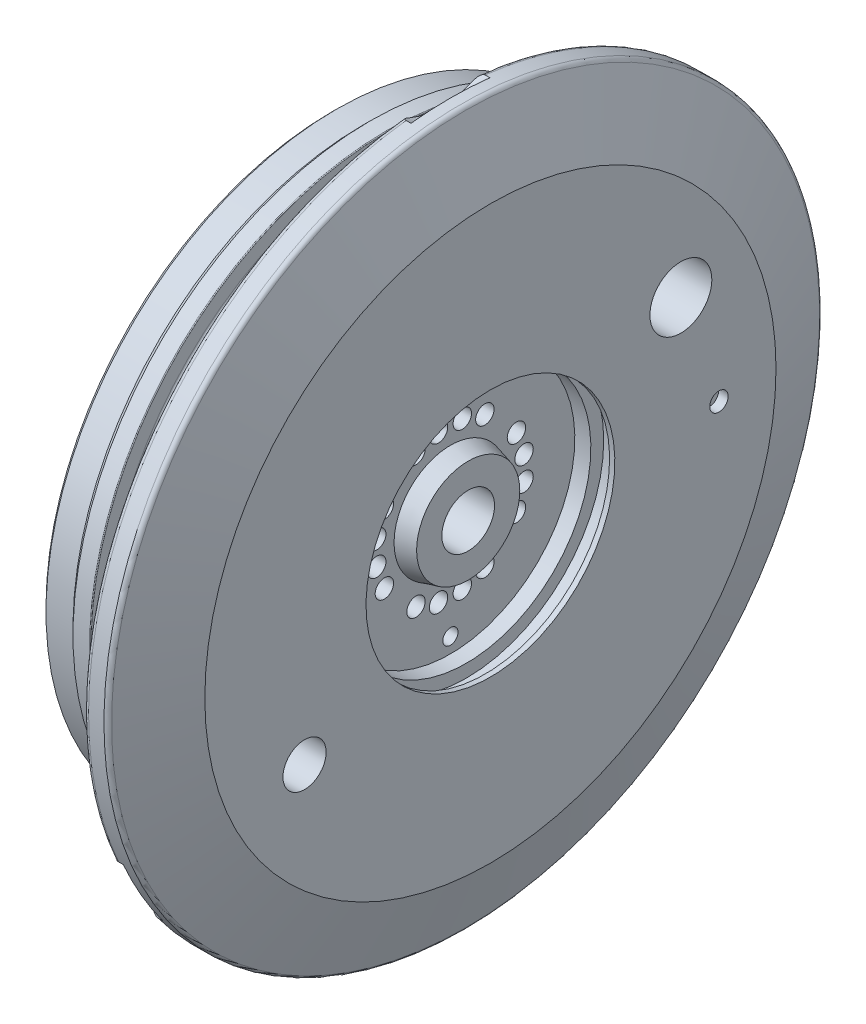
ISO-10303-21;
HEADER;
FILE_DESCRIPTION(('STEP AP214'),'2;1');
FILE_NAME('part.step','',(''),(''),'','','');
FILE_SCHEMA(('AUTOMOTIVE_DESIGN { 1 0 10303 214 1 1 1 1 }'));
ENDSEC;
DATA;
#1=APPLICATION_CONTEXT('core data for automotive mechanical design processes');
#2=APPLICATION_PROTOCOL_DEFINITION('international standard','automotive_design',2000,#1);
#3=PRODUCT_CONTEXT('',#1,'mechanical');
#4=PRODUCT('Part','Part','',(#3));
#5=PRODUCT_RELATED_PRODUCT_CATEGORY('part','',(#4));
#6=PRODUCT_DEFINITION_FORMATION('','',#4);
#7=PRODUCT_DEFINITION_CONTEXT('part definition',#1,'design');
#8=PRODUCT_DEFINITION('design','',#6,#7);
#9=PRODUCT_DEFINITION_SHAPE('','',#8);
#10=(LENGTH_UNIT() NAMED_UNIT(*) SI_UNIT(.MILLI.,.METRE.));
#11=(NAMED_UNIT(*) PLANE_ANGLE_UNIT() SI_UNIT($,.RADIAN.));
#12=(NAMED_UNIT(*) SI_UNIT($,.STERADIAN.) SOLID_ANGLE_UNIT());
#13=UNCERTAINTY_MEASURE_WITH_UNIT(LENGTH_MEASURE(1.E-05),#10,'distance_accuracy_value','');
#14=(GEOMETRIC_REPRESENTATION_CONTEXT(3) GLOBAL_UNCERTAINTY_ASSIGNED_CONTEXT((#13)) GLOBAL_UNIT_ASSIGNED_CONTEXT((#10,
#11,#12)) REPRESENTATION_CONTEXT('',''));
#15=CARTESIAN_POINT('',(0.,0.,0.));
#16=DIRECTION('',(0.,0.,1.));
#17=DIRECTION('',(1.,0.,0.));
#18=AXIS2_PLACEMENT_3D('',#15,#16,#17);
#19=CARTESIAN_POINT('',(-25.4,-17.1704,29.7434));
#20=DIRECTION('',(1.,0.,0.));
#21=DIRECTION('',(0.,1.,0.));
#22=AXIS2_PLACEMENT_3D('',#19,#20,#21);
#23=CYLINDRICAL_SURFACE('',#22,3.4544);
#24=CARTESIAN_POINT('',(0.,-17.1704,29.7434));
#25=DIRECTION('',(1.,0.,0.));
#26=DIRECTION('',(0.,1.,0.));
#27=AXIS2_PLACEMENT_3D('',#24,#25,#26);
#28=CIRCLE('',#27,3.4544);
#29=CARTESIAN_POINT('',(0.,-13.716,29.7434));
#30=VERTEX_POINT('',#29);
#31=EDGE_CURVE('E1171',#30,#30,#28,.T.);
#32=ORIENTED_EDGE('',*,*,#31,.T.);
#33=EDGE_LOOP('',(#32));
#34=FACE_BOUND('',#33,.T.);
#35=CARTESIAN_POINT('',(-9.398,-17.1704,29.7434));
#36=DIRECTION('',(-1.,0.,0.));
#37=DIRECTION('',(0.,-1.,0.));
#38=AXIS2_PLACEMENT_3D('',#35,#36,#37);
#39=CIRCLE('',#38,3.4544);
#40=CARTESIAN_POINT('',(-9.398,-20.6248,29.7434));
#41=VERTEX_POINT('',#40);
#42=EDGE_CURVE('E35',#41,#41,#39,.F.);
#43=ORIENTED_EDGE('',*,*,#42,.F.);
#44=EDGE_LOOP('',(#43));
#45=FACE_BOUND('',#44,.T.);
#46=ADVANCED_FACE('F31',(#34,#45),#23,.F.);
#47=CARTESIAN_POINT('',(-6.4008,0.,0.));
#48=DIRECTION('',(-1.,0.,0.));
#49=DIRECTION('',(0.,-1.,0.));
#50=AXIS2_PLACEMENT_3D('',#47,#48,#49);
#51=PLANE('',#50);
#52=CARTESIAN_POINT('',(-6.4008,0.,0.));
#53=DIRECTION('',(1.,0.,0.));
#54=DIRECTION('',(0.,1.,0.));
#55=AXIS2_PLACEMENT_3D('',#52,#53,#54);
#56=CIRCLE('',#55,19.9136);
#57=CARTESIAN_POINT('',(-6.4008,19.9136,0.));
#58=VERTEX_POINT('',#57);
#59=EDGE_CURVE('E408',#58,#58,#56,.T.);
#60=ORIENTED_EDGE('',*,*,#59,.T.);
#61=EDGE_LOOP('',(#60));
#62=FACE_BOUND('',#61,.T.);
#63=CARTESIAN_POINT('',(-6.4008,-17.4752,0.));
#64=DIRECTION('',(1.,0.,0.));
#65=DIRECTION('',(0.,-1.,0.));
#66=AXIS2_PLACEMENT_3D('',#63,#64,#65);
#67=CIRCLE('',#66,1.2192);
#68=CARTESIAN_POINT('',(-6.4008,-18.6944,0.));
#69=VERTEX_POINT('',#68);
#70=EDGE_CURVE('E531',#69,#69,#67,.T.);
#71=ORIENTED_EDGE('',*,*,#70,.F.);
#72=EDGE_LOOP('',(#71));
#73=FACE_BOUND('',#72,.T.);
#74=CARTESIAN_POINT('',(-6.4008,17.4752,0.));
#75=DIRECTION('',(1.,0.,0.));
#76=DIRECTION('',(0.,1.,0.));
#77=AXIS2_PLACEMENT_3D('',#74,#75,#76);
#78=CIRCLE('',#77,1.2192);
#79=CARTESIAN_POINT('',(-6.4008,18.6944,0.));
#80=VERTEX_POINT('',#79);
#81=EDGE_CURVE('E525',#80,#80,#78,.T.);
#82=ORIENTED_EDGE('',*,*,#81,.F.);
#83=EDGE_LOOP('',(#82));
#84=FACE_BOUND('',#83,.T.);
#85=CARTESIAN_POINT('',(-6.4008,10.541,5.5118));
#86=DIRECTION('',(1.,0.,0.));
#87=DIRECTION('',(0.,-1.,0.));
#88=AXIS2_PLACEMENT_3D('',#85,#86,#87);
#89=CIRCLE('',#88,1.4732);
#90=CARTESIAN_POINT('',(-6.4008,9.0678,5.5118));
#91=VERTEX_POINT('',#90);
#92=EDGE_CURVE('E516',#91,#91,#89,.T.);
#93=ORIENTED_EDGE('',*,*,#92,.F.);
#94=EDGE_LOOP('',(#93));
#95=FACE_BOUND('',#94,.T.);
#96=CARTESIAN_POINT('',(-6.4008,11.7602,1.905));
#97=DIRECTION('',(1.,0.,0.));
#98=DIRECTION('',(0.,-1.,0.));
#99=AXIS2_PLACEMENT_3D('',#96,#97,#98);
#100=CIRCLE('',#99,1.4732);
#101=CARTESIAN_POINT('',(-6.4008,10.287,1.905));
#102=VERTEX_POINT('',#101);
#103=EDGE_CURVE('E510',#102,#102,#100,.T.);
#104=ORIENTED_EDGE('',*,*,#103,.F.);
#105=EDGE_LOOP('',(#104));
#106=FACE_BOUND('',#105,.T.);
#107=CARTESIAN_POINT('',(-6.4008,5.48640000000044,-10.5664000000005));
#108=DIRECTION('',(1.,0.,0.));
#109=DIRECTION('',(0.,-1.,0.));
#110=AXIS2_PLACEMENT_3D('',#107,#108,#109);
#111=CIRCLE('',#110,1.4732);
#112=CARTESIAN_POINT('',(-6.4008,4.01320000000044,-10.5664000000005));
#113=VERTEX_POINT('',#112);
#114=EDGE_CURVE('E504',#113,#113,#111,.T.);
#115=ORIENTED_EDGE('',*,*,#114,.F.);
#116=EDGE_LOOP('',(#115));
#117=FACE_BOUND('',#116,.T.);
#118=CARTESIAN_POINT('',(-6.4008,10.541,-5.5118));
#119=DIRECTION('',(1.,0.,0.));
#120=DIRECTION('',(0.,1.,0.));
#121=AXIS2_PLACEMENT_3D('',#118,#119,#120);
#122=CIRCLE('',#121,1.4732);
#123=CARTESIAN_POINT('',(-6.4008,12.0142,-5.5118));
#124=VERTEX_POINT('',#123);
#125=EDGE_CURVE('E498',#124,#124,#122,.T.);
#126=ORIENTED_EDGE('',*,*,#125,.F.);
#127=EDGE_LOOP('',(#126));
#128=FACE_BOUND('',#127,.T.);
#129=CARTESIAN_POINT('',(-6.4008,11.7602,-1.905));
#130=DIRECTION('',(1.,0.,0.));
#131=DIRECTION('',(0.,1.,0.));
#132=AXIS2_PLACEMENT_3D('',#129,#130,#131);
#133=CIRCLE('',#132,1.4732);
#134=CARTESIAN_POINT('',(-6.4008,13.2334,-1.905));
#135=VERTEX_POINT('',#134);
#136=EDGE_CURVE('E492',#135,#135,#133,.T.);
#137=ORIENTED_EDGE('',*,*,#136,.F.);
#138=EDGE_LOOP('',(#137));
#139=FACE_BOUND('',#138,.T.);
#140=CARTESIAN_POINT('',(-6.4008,1.87960000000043,-11.7856000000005));
#141=DIRECTION('',(1.,0.,0.));
#142=DIRECTION('',(0.,-1.,0.));
#143=AXIS2_PLACEMENT_3D('',#140,#141,#142);
#144=CIRCLE('',#143,1.4732);
#145=CARTESIAN_POINT('',(-6.4008,0.406400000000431,-11.7856000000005));
#146=VERTEX_POINT('',#145);
#147=EDGE_CURVE('E486',#146,#146,#144,.T.);
#148=ORIENTED_EDGE('',*,*,#147,.F.);
#149=EDGE_LOOP('',(#148));
#150=FACE_BOUND('',#149,.T.);
#151=CARTESIAN_POINT('',(-6.4008,-5.53719999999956,-10.5664000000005));
#152=DIRECTION('',(1.,0.,0.));
#153=DIRECTION('',(0.,1.,0.));
#154=AXIS2_PLACEMENT_3D('',#151,#152,#153);
#155=CIRCLE('',#154,1.4732);
#156=CARTESIAN_POINT('',(-6.4008,-4.06399999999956,-10.5664000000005));
#157=VERTEX_POINT('',#156);
#158=EDGE_CURVE('E480',#157,#157,#155,.T.);
#159=ORIENTED_EDGE('',*,*,#158,.F.);
#160=EDGE_LOOP('',(#159));
#161=FACE_BOUND('',#160,.T.);
#162=CARTESIAN_POINT('',(-6.4008,-1.93039999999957,-11.7856000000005));
#163=DIRECTION('',(1.,0.,0.));
#164=DIRECTION('',(0.,1.,0.));
#165=AXIS2_PLACEMENT_3D('',#162,#163,#164);
#166=CIRCLE('',#165,1.4732);
#167=CARTESIAN_POINT('',(-6.4008,-0.457199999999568,-11.7856000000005));
#168=VERTEX_POINT('',#167);
#169=EDGE_CURVE('E474',#168,#168,#166,.T.);
#170=ORIENTED_EDGE('',*,*,#169,.F.);
#171=EDGE_LOOP('',(#170));
#172=FACE_BOUND('',#171,.T.);
#173=CARTESIAN_POINT('',(-6.4008,-10.5918,-5.51180000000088));
#174=DIRECTION('',(1.,0.,0.));
#175=DIRECTION('',(0.,-1.,0.));
#176=AXIS2_PLACEMENT_3D('',#173,#174,#175);
#177=CIRCLE('',#176,1.4732);
#178=CARTESIAN_POINT('',(-6.4008,-12.065,-5.51180000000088));
#179=VERTEX_POINT('',#178);
#180=EDGE_CURVE('E468',#179,#179,#177,.T.);
#181=ORIENTED_EDGE('',*,*,#180,.F.);
#182=EDGE_LOOP('',(#181));
#183=FACE_BOUND('',#182,.T.);
#184=CARTESIAN_POINT('',(-6.4008,-11.811,-1.90500000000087));
#185=DIRECTION('',(1.,0.,0.));
#186=DIRECTION('',(0.,-1.,0.));
#187=AXIS2_PLACEMENT_3D('',#184,#185,#186);
#188=CIRCLE('',#187,1.4732);
#189=CARTESIAN_POINT('',(-6.4008,-13.2842,-1.90500000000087));
#190=VERTEX_POINT('',#189);
#191=EDGE_CURVE('E462',#190,#190,#188,.T.);
#192=ORIENTED_EDGE('',*,*,#191,.F.);
#193=EDGE_LOOP('',(#192));
#194=FACE_BOUND('',#193,.T.);
#195=CARTESIAN_POINT('',(-6.4008,-10.5918,5.51179999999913));
#196=DIRECTION('',(1.,0.,0.));
#197=DIRECTION('',(0.,1.,0.));
#198=AXIS2_PLACEMENT_3D('',#195,#196,#197);
#199=CIRCLE('',#198,1.4732);
#200=CARTESIAN_POINT('',(-6.4008,-9.11859999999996,5.51179999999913));
#201=VERTEX_POINT('',#200);
#202=EDGE_CURVE('E456',#201,#201,#199,.T.);
#203=ORIENTED_EDGE('',*,*,#202,.F.);
#204=EDGE_LOOP('',(#203));
#205=FACE_BOUND('',#204,.T.);
#206=CARTESIAN_POINT('',(-6.4008,-11.811,1.90499999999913));
#207=DIRECTION('',(1.,0.,0.));
#208=DIRECTION('',(0.,1.,0.));
#209=AXIS2_PLACEMENT_3D('',#206,#207,#208);
#210=CIRCLE('',#209,1.4732);
#211=CARTESIAN_POINT('',(-6.4008,-10.3378,1.90499999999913));
#212=VERTEX_POINT('',#211);
#213=EDGE_CURVE('E450',#212,#212,#210,.T.);
#214=ORIENTED_EDGE('',*,*,#213,.F.);
#215=EDGE_LOOP('',(#214));
#216=FACE_BOUND('',#215,.T.);
#217=CARTESIAN_POINT('',(-6.4008,-5.53720000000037,10.5663999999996));
#218=DIRECTION('',(1.,0.,0.));
#219=DIRECTION('',(0.,-1.,0.));
#220=AXIS2_PLACEMENT_3D('',#217,#218,#219);
#221=CIRCLE('',#220,1.4732);
#222=CARTESIAN_POINT('',(-6.4008,-7.01040000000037,10.5663999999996));
#223=VERTEX_POINT('',#222);
#224=EDGE_CURVE('E444',#223,#223,#221,.T.);
#225=ORIENTED_EDGE('',*,*,#224,.F.);
#226=EDGE_LOOP('',(#225));
#227=FACE_BOUND('',#226,.T.);
#228=CARTESIAN_POINT('',(-6.4008,-1.93040000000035,11.7855999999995));
#229=DIRECTION('',(1.,0.,0.));
#230=DIRECTION('',(0.,-1.,0.));
#231=AXIS2_PLACEMENT_3D('',#228,#229,#230);
#232=CIRCLE('',#231,1.4732);
#233=CARTESIAN_POINT('',(-6.4008,-3.40360000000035,11.7855999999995));
#234=VERTEX_POINT('',#233);
#235=EDGE_CURVE('E438',#234,#234,#232,.T.);
#236=ORIENTED_EDGE('',*,*,#235,.F.);
#237=EDGE_LOOP('',(#236));
#238=FACE_BOUND('',#237,.T.);
#239=CARTESIAN_POINT('',(-6.4008,5.48639999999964,10.5663999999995));
#240=DIRECTION('',(1.,0.,0.));
#241=DIRECTION('',(0.,1.,0.));
#242=AXIS2_PLACEMENT_3D('',#239,#240,#241);
#243=CIRCLE('',#242,1.4732);
#244=CARTESIAN_POINT('',(-6.4008,6.95959999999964,10.5663999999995));
#245=VERTEX_POINT('',#244);
#246=EDGE_CURVE('E432',#245,#245,#243,.T.);
#247=ORIENTED_EDGE('',*,*,#246,.F.);
#248=EDGE_LOOP('',(#247));
#249=FACE_BOUND('',#248,.T.);
#250=CARTESIAN_POINT('',(-6.4008,1.87959999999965,11.7855999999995));
#251=DIRECTION('',(1.,0.,0.));
#252=DIRECTION('',(0.,1.,0.));
#253=AXIS2_PLACEMENT_3D('',#250,#251,#252);
#254=CIRCLE('',#253,1.4732);
#255=CARTESIAN_POINT('',(-6.4008,3.35279999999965,11.7855999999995));
#256=VERTEX_POINT('',#255);
#257=EDGE_CURVE('E419',#256,#256,#254,.T.);
#258=ORIENTED_EDGE('',*,*,#257,.F.);
#259=EDGE_LOOP('',(#258));
#260=FACE_BOUND('',#259,.T.);
#261=CARTESIAN_POINT('',(-6.4008,0.,0.));
#262=DIRECTION('',(-1.,0.,0.));
#263=DIRECTION('',(0.,-1.,0.));
#264=AXIS2_PLACEMENT_3D('',#261,#262,#263);
#265=CIRCLE('',#264,9.017);
#266=CARTESIAN_POINT('',(-6.4008,-9.017,0.));
#267=VERTEX_POINT('',#266);
#268=EDGE_CURVE('E40',#267,#267,#265,.F.);
#269=ORIENTED_EDGE('',*,*,#268,.F.);
#270=EDGE_LOOP('',(#269));
#271=FACE_BOUND('',#270,.T.);
#272=ADVANCED_FACE('F242',(#62,#73,#84,#95,#106,#117,#128,#139,#150,#161,#172,#183,#194,#205,
#216,#227,#238,#249,#260,#271),#51,.F.);
#273=CARTESIAN_POINT('',(-7.1628,0.,0.));
#274=DIRECTION('',(-1.,0.,0.));
#275=DIRECTION('',(0.,-1.,0.));
#276=AXIS2_PLACEMENT_3D('',#273,#274,#275);
#277=TOROIDAL_SURFACE('',#276,56.388,0.762);
#278=CARTESIAN_POINT('',(-7.16259999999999,-24.9784884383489,-49.7023841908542));
#279=CARTESIAN_POINT('',(-7.1783643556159,-24.9785379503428,-49.7023364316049));
#280=CARTESIAN_POINT('',(-7.19404707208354,-24.9773836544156,-49.7034767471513));
#281=CARTESIAN_POINT('',(-7.22460858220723,-24.9730567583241,-49.7077586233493));
#282=CARTESIAN_POINT('',(-7.23949610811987,-24.9699159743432,-49.7108686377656));
#283=CARTESIAN_POINT('',(-7.27225480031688,-24.9609092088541,-49.7198015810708));
#284=CARTESIAN_POINT('',(-7.289840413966,-24.95453520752,-49.726131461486));
#285=CARTESIAN_POINT('',(-7.32346125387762,-24.9399106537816,-49.7406957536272));
#286=CARTESIAN_POINT('',(-7.33948513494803,-24.9316476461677,-49.7489428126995));
#287=CARTESIAN_POINT('',(-7.38257774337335,-24.9065939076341,-49.7740307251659));
#288=CARTESIAN_POINT('',(-7.40791509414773,-24.8883710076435,-49.7923687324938));
#289=CARTESIAN_POINT('',(-7.4548884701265,-24.849892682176,-49.8313614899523));
#290=CARTESIAN_POINT('',(-7.47651687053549,-24.8296332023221,-49.852020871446));
#291=CARTESIAN_POINT('',(-7.52749195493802,-24.7772506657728,-49.9058325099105));
#292=CARTESIAN_POINT('',(-7.55506858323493,-24.7443964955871,-49.9399340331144));
#293=CARTESIAN_POINT('',(-7.60590408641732,-24.6775099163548,-50.0101864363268));
#294=CARTESIAN_POINT('',(-7.62915360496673,-24.6434751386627,-50.0463415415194));
#295=CARTESIAN_POINT('',(-7.67240746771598,-24.5746691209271,-50.1203263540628));
#296=CARTESIAN_POINT('',(-7.69239208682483,-24.5398947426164,-50.1581646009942));
#297=CARTESIAN_POINT('',(-7.72950578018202,-24.4701762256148,-50.2349760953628));
#298=CARTESIAN_POINT('',(-7.74663731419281,-24.4352322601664,-50.2739483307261));
#299=CARTESIAN_POINT('',(-7.792696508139,-24.3339321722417,-50.3883659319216));
#300=CARTESIAN_POINT('',(-7.81839125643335,-24.2675648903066,-50.4651175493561));
#301=CARTESIAN_POINT('',(-7.86175526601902,-24.1355697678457,-50.6215889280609));
#302=CARTESIAN_POINT('',(-7.87941515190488,-24.0699428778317,-50.7013120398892));
#303=CARTESIAN_POINT('',(-7.90644262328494,-23.9403899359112,-50.8627108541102));
#304=CARTESIAN_POINT('',(-7.91585958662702,-23.8764560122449,-50.9443718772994));
#305=CARTESIAN_POINT('',(-7.92575855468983,-23.7504131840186,-51.1095208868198));
#306=CARTESIAN_POINT('',(-7.92625178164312,-23.6883020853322,-51.1930064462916));
#307=CARTESIAN_POINT('',(-7.91820148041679,-23.5848356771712,-51.3357001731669));
#308=CARTESIAN_POINT('',(-7.91234248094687,-23.5428776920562,-51.3946246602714));
#309=CARTESIAN_POINT('',(-7.89468790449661,-23.460228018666,-51.512805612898));
#310=CARTESIAN_POINT('',(-7.88287390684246,-23.4195406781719,-51.5720625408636));
#311=CARTESIAN_POINT('',(-7.8574726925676,-23.3537188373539,-51.6696596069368));
#312=CARTESIAN_POINT('',(-7.84590002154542,-23.3280571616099,-51.7081697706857));
#313=CARTESIAN_POINT('',(-7.81928863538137,-23.27767588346,-51.7846621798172));
#314=CARTESIAN_POINT('',(-7.80424786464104,-23.2529568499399,-51.822644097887));
#315=CARTESIAN_POINT('',(-7.77027966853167,-23.2048525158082,-51.8974058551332));
#316=CARTESIAN_POINT('',(-7.75137294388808,-23.1814609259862,-51.9341909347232));
#317=CARTESIAN_POINT('',(-7.70902667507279,-23.1362629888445,-52.0060472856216));
#318=CARTESIAN_POINT('',(-7.68559462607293,-23.1144541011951,-52.0411212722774));
#319=CARTESIAN_POINT('',(-7.63978544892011,-23.0779833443,-52.1003704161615));
#320=CARTESIAN_POINT('',(-7.61852793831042,-23.0628699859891,-52.1251274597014));
#321=CARTESIAN_POINT('',(-7.5726397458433,-23.0342028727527,-52.1724194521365));
#322=CARTESIAN_POINT('',(-7.54800582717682,-23.0206506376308,-52.1949522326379));
#323=CARTESIAN_POINT('',(-7.49483058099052,-22.9954844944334,-52.2370521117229));
#324=CARTESIAN_POINT('',(-7.4662467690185,-22.9838952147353,-52.2565812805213));
#325=CARTESIAN_POINT('',(-7.40555290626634,-22.9636042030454,-52.2909378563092));
#326=CARTESIAN_POINT('',(-7.37345932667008,-22.9548896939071,-52.3057860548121));
#327=CARTESIAN_POINT('',(-7.31196800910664,-22.9422614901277,-52.3273642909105));
#328=CARTESIAN_POINT('',(-7.28302750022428,-22.9377862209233,-52.3350407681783));
#329=CARTESIAN_POINT('',(-7.23857950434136,-22.9332335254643,-52.3428574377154));
#330=CARTESIAN_POINT('',(-7.22348985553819,-22.9320756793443,-52.3448472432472));
#331=CARTESIAN_POINT('',(-7.19313693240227,-22.9305266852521,-52.3475102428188));
#332=CARTESIAN_POINT('',(-7.17787346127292,-22.9301365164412,-52.3481817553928));
#333=CARTESIAN_POINT('',(-7.16259999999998,-22.9301420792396,-52.3481717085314));
#334=B_SPLINE_CURVE_WITH_KNOTS('',3,(#278,#279,#280,#281,#282,#283,#284,#285,#286,#287,#288,
#289,#290,#291,#292,#293,#294,#295,#296,#297,#298,#299,#300,#301,#302,#303,#304,#305,#306,#307,
#308,#309,#310,#311,#312,#313,#314,#315,#316,#317,#318,#319,#320,#321,#322,#323,#324,#325,#326,
#327,#328,#329,#330,#331,#332,#333),.UNSPECIFIED.,.F.,.F.,(4,2,2,2,2,2,2,2,2,2,2,2,2,2,2,2,2,2,
2,2,2,2,2,2,2,2,2,4),(0.,0.0470755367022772,0.0934155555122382,0.152320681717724,
0.211626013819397,0.319614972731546,0.427823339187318,0.59182272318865,0.756172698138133,
0.921481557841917,1.08664715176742,1.40022625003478,1.71417031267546,2.02622061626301,
2.33787846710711,2.55540092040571,2.77360040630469,2.91659532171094,3.05967521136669,
3.20200813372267,3.34410730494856,3.45178211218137,3.5595608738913,3.66860517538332,
3.77715807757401,3.86741621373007,3.91313913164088,3.95892033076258),.UNSPECIFIED.);
#335=CARTESIAN_POINT('',(-7.92479999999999,-23.7138976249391,-51.1591399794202));
#336=VERTEX_POINT('',#335);
#337=CARTESIAN_POINT('',(-7.16280000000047,-22.9301420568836,-52.3481717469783));
#338=VERTEX_POINT('',#337);
#339=EDGE_CURVE('E110',#336,#338,#334,.T.);
#340=ORIENTED_EDGE('',*,*,#339,.F.);
#341=CARTESIAN_POINT('',(-7.9248,0.,0.));
#342=DIRECTION('',(-1.,0.,0.));
#343=DIRECTION('',(0.,-1.,0.));
#344=AXIS2_PLACEMENT_3D('',#341,#342,#343);
#345=CIRCLE('',#344,56.388);
#346=CARTESIAN_POINT('',(-7.9248,56.162063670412,-5.04273222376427));
#347=VERTEX_POINT('',#346);
#348=EDGE_CURVE('E118',#347,#336,#345,.T.);
#349=ORIENTED_EDGE('',*,*,#348,.F.);
#350=CARTESIAN_POINT('',(-7.16259999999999,56.7999175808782,-6.31600030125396));
#351=CARTESIAN_POINT('',(-7.17795757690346,56.7999234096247,-6.3160099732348));
#352=CARTESIAN_POINT('',(-7.19330433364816,56.7995327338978,-6.31532898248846));
#353=CARTESIAN_POINT('',(-7.22382264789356,56.7979843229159,-6.31262689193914));
#354=CARTESIAN_POINT('',(-7.23899439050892,56.7968274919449,-6.31060737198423));
#355=CARTESIAN_POINT('',(-7.28369635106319,56.7922833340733,-6.30266690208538));
#356=CARTESIAN_POINT('',(-7.31280316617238,56.7878209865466,-6.29486186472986));
#357=CARTESIAN_POINT('',(-7.36880070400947,56.776489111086,-6.27496330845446));
#358=CARTESIAN_POINT('',(-7.3957003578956,56.7696299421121,-6.2628882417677));
#359=CARTESIAN_POINT('',(-7.44711898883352,56.7540119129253,-6.23525631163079));
#360=CARTESIAN_POINT('',(-7.47163030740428,56.7452472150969,-6.21968874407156));
#361=CARTESIAN_POINT('',(-7.53017442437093,56.7213948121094,-6.17707138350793));
#362=CARTESIAN_POINT('',(-7.56254063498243,56.7053873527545,-6.14825732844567));
#363=CARTESIAN_POINT('',(-7.6217783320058,56.6714244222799,-6.08646946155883));
#364=CARTESIAN_POINT('',(-7.64863722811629,56.6534646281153,-6.05348639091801));
#365=CARTESIAN_POINT('',(-7.713459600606,56.6043897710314,-5.96230395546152));
#366=CARTESIAN_POINT('',(-7.74725793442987,56.5723268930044,-5.90167551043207));
#367=CARTESIAN_POINT('',(-7.80446073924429,56.5073767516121,-5.77623076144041));
#368=CARTESIAN_POINT('',(-7.82784662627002,56.4744881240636,-5.71140720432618));
#369=CARTESIAN_POINT('',(-7.86425089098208,56.4123424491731,-5.58617433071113));
#370=CARTESIAN_POINT('',(-7.87809563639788,56.3830640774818,-5.52600886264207));
#371=CARTESIAN_POINT('',(-7.90013820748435,56.3250684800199,-5.40435684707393));
#372=CARTESIAN_POINT('',(-7.90833151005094,56.2963517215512,-5.34286928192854));
#373=CARTESIAN_POINT('',(-7.91986415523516,56.2396408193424,-5.21883775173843));
#374=CARTESIAN_POINT('',(-7.92318459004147,56.2116499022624,-5.15629061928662));
#375=CARTESIAN_POINT('',(-7.92548939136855,56.1566543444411,-5.03067822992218));
#376=CARTESIAN_POINT('',(-7.92447244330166,56.1296500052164,-4.96761282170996));
#377=CARTESIAN_POINT('',(-7.91697834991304,56.0629644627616,-4.80832382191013));
#378=CARTESIAN_POINT('',(-7.90793614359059,56.0239958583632,-4.71191632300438));
#379=CARTESIAN_POINT('',(-7.88168958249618,55.9488133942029,-4.51919431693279));
#380=CARTESIAN_POINT('',(-7.86448671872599,55.912599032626,-4.42287979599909));
#381=CARTESIAN_POINT('',(-7.8221889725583,55.8432106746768,-4.23139729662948));
#382=CARTESIAN_POINT('',(-7.79713235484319,55.8100229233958,-4.13622603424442));
#383=CARTESIAN_POINT('',(-7.75302323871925,55.7625523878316,-3.99482900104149));
#384=CARTESIAN_POINT('',(-7.73724476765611,55.7471230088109,-3.94795226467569));
#385=CARTESIAN_POINT('',(-7.70324326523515,55.7170645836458,-3.85483473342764));
#386=CARTESIAN_POINT('',(-7.68502087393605,55.7024353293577,-3.80859377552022));
#387=CARTESIAN_POINT('',(-7.64919281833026,55.6765636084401,-3.72519485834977));
#388=CARTESIAN_POINT('',(-7.63205170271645,55.6651808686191,-3.68788141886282));
#389=CARTESIAN_POINT('',(-7.59538691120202,55.6430434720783,-3.61412730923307));
#390=CARTESIAN_POINT('',(-7.57585834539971,55.6322901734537,-3.57768861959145));
#391=CARTESIAN_POINT('',(-7.53170151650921,55.6105125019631,-3.50270251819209));
#392=CARTESIAN_POINT('',(-7.50675691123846,55.5995712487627,-3.46431605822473));
#393=CARTESIAN_POINT('',(-7.45189126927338,55.5789871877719,-3.39086828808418));
#394=CARTESIAN_POINT('',(-7.42199220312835,55.5693389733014,-3.35579332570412));
#395=CARTESIAN_POINT('',(-7.37479054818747,55.5573410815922,-3.31155927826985));
#396=CARTESIAN_POINT('',(-7.36057609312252,55.5540641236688,-3.29939629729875));
#397=CARTESIAN_POINT('',(-7.3307103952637,55.5480058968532,-3.27679407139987));
#398=CARTESIAN_POINT('',(-7.31505965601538,55.5452244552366,-3.26635422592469));
#399=CARTESIAN_POINT('',(-7.2848925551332,55.5407408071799,-3.24945703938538));
#400=CARTESIAN_POINT('',(-7.27060273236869,55.5389367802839,-3.24262858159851));
#401=CARTESIAN_POINT('',(-7.24107324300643,55.5359592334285,-3.23133241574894));
#402=CARTESIAN_POINT('',(-7.22583706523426,55.5347835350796,-3.22685655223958));
#403=CARTESIAN_POINT('',(-7.2024722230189,55.5335857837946,-3.22229263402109));
#404=CARTESIAN_POINT('',(-7.19456023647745,55.5332807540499,-3.22112932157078));
#405=CARTESIAN_POINT('',(-7.17863428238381,55.532872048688,-3.21957007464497));
#406=CARTESIAN_POINT('',(-7.17062009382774,55.5327689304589,-3.21917626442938));
#407=CARTESIAN_POINT('',(-7.16259999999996,55.5327715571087,-3.21918655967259));
#408=B_SPLINE_CURVE_WITH_KNOTS('',3,(#350,#351,#352,#353,#354,#355,#356,#357,#358,#359,#360,
#361,#362,#363,#364,#365,#366,#367,#368,#369,#370,#371,#372,#373,#374,#375,#376,#377,#378,#379,
#380,#381,#382,#383,#384,#385,#386,#387,#388,#389,#390,#391,#392,#393,#394,#395,#396,#397,#398,
#399,#400,#401,#402,#403,#404,#405,#406,#407),.UNSPECIFIED.,.F.,.F.,(4,2,2,2,2,2,2,2,2,2,2,2,2,
2,2,2,2,2,2,2,2,2,2,2,2,2,2,2,4),(0.,0.0460315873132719,0.0920089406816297,0.182815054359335,
0.273233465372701,0.363932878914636,0.501738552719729,0.639855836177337,0.867953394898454,
1.09645644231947,1.30114993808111,1.50600706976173,1.71165701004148,1.91736928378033,
2.23008657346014,2.54274674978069,2.85390667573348,3.00929191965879,3.16463654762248,
3.2924101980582,3.42045007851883,3.56147599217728,3.70189248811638,3.75877326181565,
3.81563416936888,3.86328982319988,3.91077916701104,3.9347514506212,3.95878981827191),.UNSPECIFIED.);
#409=CARTESIAN_POINT('',(-7.1628,56.7999176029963,-6.31600033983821));
#410=VERTEX_POINT('',#409);
#411=EDGE_CURVE('E179',#410,#347,#408,.T.);
#412=ORIENTED_EDGE('',*,*,#411,.F.);
#413=CARTESIAN_POINT('',(-7.1628,0.,0.));
#414=DIRECTION('',(-1.,0.,0.));
#415=DIRECTION('',(0.,-1.,0.));
#416=AXIS2_PLACEMENT_3D('',#413,#414,#415);
#417=CIRCLE('',#416,57.15);
#418=EDGE_CURVE('E596',#338,#410,#417,.F.);
#419=ORIENTED_EDGE('',*,*,#418,.F.);
#420=EDGE_LOOP('',(#340,#349,#412,#419));
#421=FACE_BOUND('',#420,.T.);
#422=ADVANCED_FACE('F237',(#421),#277,.T.);
#423=CARTESIAN_POINT('',(-7.16259999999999,-22.9301420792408,52.3481717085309));
#424=CARTESIAN_POINT('',(-7.17795757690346,-22.9301366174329,52.3481815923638));
#425=CARTESIAN_POINT('',(-7.19330433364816,-22.9305310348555,52.3475027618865));
#426=CARTESIAN_POINT('',(-7.22382264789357,-22.9320969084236,52.344810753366));
#427=CARTESIAN_POINT('',(-7.23899439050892,-22.9332674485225,52.3427991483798));
#428=CARTESIAN_POINT('',(-7.2836963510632,-22.9378720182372,52.3348935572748));
#429=CARTESIAN_POINT('',(-7.31280316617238,-22.9424002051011,52.3271265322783));
#430=CARTESIAN_POINT('',(-7.36880070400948,-22.953966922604,52.3073635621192));
#431=CARTESIAN_POINT('',(-7.39570035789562,-22.9609946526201,52.2953858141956));
#432=CARTESIAN_POINT('',(-7.44711898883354,-22.9771155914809,52.2680442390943));
#433=CARTESIAN_POINT('',(-7.4716303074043,-22.9862151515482,52.2526700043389));
#434=CARTESIAN_POINT('',(-7.53017442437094,-23.0111966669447,52.2107045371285));
#435=CARTESIAN_POINT('',(-7.56254063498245,-23.0281466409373,52.1824346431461));
#436=CARTESIAN_POINT('',(-7.62177833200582,-23.0646750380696,52.1221279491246));
#437=CARTESIAN_POINT('',(-7.64863722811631,-23.0842593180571,52.0900827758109));
#438=CARTESIAN_POINT('',(-7.71345960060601,-23.1386881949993,52.0019914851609));
#439=CARTESIAN_POINT('',(-7.74725793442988,-23.1751625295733,51.9439099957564));
#440=CARTESIAN_POINT('',(-7.8044607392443,-23.2513257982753,51.8249391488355));
#441=CARTESIAN_POINT('',(-7.82784662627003,-23.2910203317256,51.7640449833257));
#442=CARTESIAN_POINT('',(-7.86425089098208,-23.3684023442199,51.6476088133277));
#443=CARTESIAN_POINT('',(-7.87809563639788,-23.4058679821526,51.5921702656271));
#444=CARTESIAN_POINT('',(-7.90013820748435,-23.4822239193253,51.4811185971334));
#445=CARTESIAN_POINT('',(-7.90833151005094,-23.5211153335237,51.4255053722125));
#446=CARTESIAN_POINT('',(-7.91986415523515,-23.6001743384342,51.3143765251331));
#447=CARTESIAN_POINT('',(-7.92318459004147,-23.6403462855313,51.2588621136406));
#448=CARTESIAN_POINT('',(-7.92548939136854,-23.7216320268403,51.1484283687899));
#449=CARTESIAN_POINT('',(-7.92447244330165,-23.7627461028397,51.0935092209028));
#450=CARTESIAN_POINT('',(-7.91697834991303,-23.8673516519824,50.956113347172));
#451=CARTESIAN_POINT('',(-7.90793614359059,-23.9313586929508,50.87416179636));
#452=CARTESIAN_POINT('',(-7.88168958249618,-24.0606696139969,50.7126908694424));
#453=CARTESIAN_POINT('',(-7.864486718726,-24.1259732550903,50.6331710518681));
#454=CARTESIAN_POINT('',(-7.82218897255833,-24.2571077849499,50.4773377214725));
#455=CARTESIAN_POINT('',(-7.79713235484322,-24.322934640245,50.4010106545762));
#456=CARTESIAN_POINT('',(-7.7530232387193,-24.4216527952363,50.2892014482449));
#457=CARTESIAN_POINT('',(-7.73724476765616,-24.4545345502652,50.2524008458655));
#458=CARTESIAN_POINT('',(-7.70324326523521,-24.5201474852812,50.1798107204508));
#459=CARTESIAN_POINT('',(-7.68502087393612,-24.5528787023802,50.1440209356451));
#460=CARTESIAN_POINT('',(-7.64919281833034,-24.6121684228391,50.0799159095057));
#461=CARTESIAN_POINT('',(-7.63205170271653,-24.6387914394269,50.0514014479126));
#462=CARTESIAN_POINT('',(-7.59538691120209,-24.6915956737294,49.9953528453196));
#463=CARTESIAN_POINT('',(-7.57585834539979,-24.7177758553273,49.9678208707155));
#464=CARTESIAN_POINT('',(-7.53170151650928,-24.7718268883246,49.9114678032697));
#465=CARTESIAN_POINT('',(-7.50675691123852,-24.7995999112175,49.8827991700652));
#466=CARTESIAN_POINT('',(-7.45189126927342,-24.8529155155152,49.8282489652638));
#467=CARTESIAN_POINT('',(-7.42199220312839,-24.8784672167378,49.8023558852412));
#468=CARTESIAN_POINT('',(-7.37479054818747,-24.9107760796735,49.769848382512));
#469=CARTESIAN_POINT('',(-7.36057609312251,-24.9196710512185,49.7609289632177));
#470=CARTESIAN_POINT('',(-7.33071039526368,-24.9362160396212,49.744381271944));
#471=CARTESIAN_POINT('',(-7.31505965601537,-24.943866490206,49.7367525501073));
#472=CARTESIAN_POINT('',(-7.28489255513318,-24.9562580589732,49.7244210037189));
#473=CARTESIAN_POINT('',(-7.27060273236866,-24.9612696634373,49.7194444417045));
#474=CARTESIAN_POINT('',(-7.24107324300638,-24.9695636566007,49.711217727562));
#475=CARTESIAN_POINT('',(-7.2258370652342,-24.9728520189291,49.7079616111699));
#476=CARTESIAN_POINT('',(-7.20247222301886,-24.9762056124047,49.7046423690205));
#477=CARTESIAN_POINT('',(-7.19456023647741,-24.9770605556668,49.7037965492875));
#478=CARTESIAN_POINT('',(-7.17863428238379,-24.9782065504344,49.7026629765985));
#479=CARTESIAN_POINT('',(-7.17062009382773,-24.9784960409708,49.7023767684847));
#480=CARTESIAN_POINT('',(-7.16259999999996,-24.9784884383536,49.7023841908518));
#481=B_SPLINE_CURVE_WITH_KNOTS('',3,(#423,#424,#425,#426,#427,#428,#429,#430,#431,#432,#433,
#434,#435,#436,#437,#438,#439,#440,#441,#442,#443,#444,#445,#446,#447,#448,#449,#450,#451,#452,
#453,#454,#455,#456,#457,#458,#459,#460,#461,#462,#463,#464,#465,#466,#467,#468,#469,#470,#471,
#472,#473,#474,#475,#476,#477,#478,#479,#480),.UNSPECIFIED.,.F.,.F.,(4,2,2,2,2,2,2,2,2,2,2,2,2,
2,2,2,2,2,2,2,2,2,2,2,2,2,2,2,4),(0.,0.0460315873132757,0.0920089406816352,0.18281505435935,
0.273233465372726,0.363932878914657,0.501738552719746,0.639855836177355,0.867953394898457,
1.09645644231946,1.30114993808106,1.50600706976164,1.71165701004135,1.91736928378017,
2.23008657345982,2.54274674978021,2.85390667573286,3.00929191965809,3.16463654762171,
3.29241019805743,3.42045007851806,3.56147599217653,3.70189248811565,3.75877326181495,
3.81563416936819,3.8632898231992,3.91077916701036,3.9347514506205,3.95878981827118),.UNSPECIFIED.);
#482=CARTESIAN_POINT('',(-7.16279999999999,-22.9301420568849,52.3481717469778));
#483=VERTEX_POINT('',#482);
#484=CARTESIAN_POINT('',(-7.92479999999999,-23.7138976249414,51.1591399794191));
#485=VERTEX_POINT('',#484);
#486=EDGE_CURVE('E620',#483,#485,#481,.T.);
#487=ORIENTED_EDGE('',*,*,#486,.F.);
#488=CARTESIAN_POINT('',(-7.16280000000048,56.7999176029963,6.31600033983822));
#489=VERTEX_POINT('',#488);
#490=EDGE_CURVE('E597',#489,#483,#417,.F.);
#491=ORIENTED_EDGE('',*,*,#490,.F.);
#492=CARTESIAN_POINT('',(-7.16259999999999,55.5327715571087,3.21918655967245));
#493=CARTESIAN_POINT('',(-7.17836435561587,55.5327549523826,3.21911980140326));
#494=CARTESIAN_POINT('',(-7.19404707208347,55.5331653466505,3.22068960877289));
#495=CARTESIAN_POINT('',(-7.22460858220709,55.5347101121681,3.22657774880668));
#496=CARTESIAN_POINT('',(-7.23949610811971,55.5358330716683,3.23085275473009));
#497=CARTESIAN_POINT('',(-7.27225480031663,55.5390658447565,3.24311931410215));
#498=CARTESIAN_POINT('',(-7.28984041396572,55.5413606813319,3.25180430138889));
#499=CARTESIAN_POINT('',(-7.32346125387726,55.5466614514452,3.27175168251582));
#500=CARTESIAN_POINT('',(-7.33948513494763,55.5496721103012,3.28303118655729));
#501=CARTESIAN_POINT('',(-7.38257774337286,55.5588720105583,3.31727231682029));
#502=CARTESIAN_POINT('',(-7.40791509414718,55.5656417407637,3.34222281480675));
#503=CARTESIAN_POINT('',(-7.45488847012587,55.5801712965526,3.39504240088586));
#504=CARTESIAN_POINT('',(-7.47651687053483,55.5879331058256,3.42291731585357));
#505=CARTESIAN_POINT('',(-7.52749195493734,55.6083440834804,3.4951877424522));
#506=CARTESIAN_POINT('',(-7.55506858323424,55.6214497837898,3.5406910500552));
#507=CARTESIAN_POINT('',(-7.60590408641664,55.6488468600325,3.63374272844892));
#508=CARTESIAN_POINT('',(-7.62915360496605,55.6631407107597,3.68129526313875));
#509=CARTESIAN_POINT('',(-7.67240746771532,55.6928104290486,3.7778754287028));
#510=CARTESIAN_POINT('',(-7.69239208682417,55.7081921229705,3.82691004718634));
#511=CARTESIAN_POINT('',(-7.72950578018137,55.7398535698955,3.92569380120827));
#512=CARTESIAN_POINT('',(-7.74663731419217,55.7561325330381,3.97544228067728));
#513=CARTESIAN_POINT('',(-7.79269650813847,55.8045710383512,4.12037953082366));
#514=CARTESIAN_POINT('',(-7.81839125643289,55.8378562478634,4.21623109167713));
#515=CARTESIAN_POINT('',(-7.86175526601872,55.9073668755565,4.4087779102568));
#516=CARTESIAN_POINT('',(-7.87941515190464,55.9435956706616,4.50547402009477));
#517=CARTESIAN_POINT('',(-7.90644262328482,56.0185946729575,4.69836956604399));
#518=CARTESIAN_POINT('',(-7.91585958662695,56.0573482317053,4.79456847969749));
#519=CARTESIAN_POINT('',(-7.92575855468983,56.1373500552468,4.98629927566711));
#520=CARTESIAN_POINT('',(-7.92625178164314,56.1785951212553,5.08183184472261));
#521=CARTESIAN_POINT('',(-7.91820148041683,56.2504383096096,5.24278324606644));
#522=CARTESIAN_POINT('',(-7.91234248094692,56.2804894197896,5.30858217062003));
#523=CARTESIAN_POINT('',(-7.89468790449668,56.3415122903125,5.43924936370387));
#524=CARTESIAN_POINT('',(-7.88287390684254,56.3724866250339,5.50411409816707));
#525=CARTESIAN_POINT('',(-7.85747269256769,56.4240972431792,5.6099160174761));
#526=CARTESIAN_POINT('',(-7.84590002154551,56.4446171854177,5.65139476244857));
#527=CARTESIAN_POINT('',(-7.81928863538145,56.4856709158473,5.73327243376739));
#528=CARTESIAN_POINT('',(-7.80424786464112,56.5062047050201,5.77367070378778));
#529=CARTESIAN_POINT('',(-7.77027966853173,56.5468981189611,5.85271115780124));
#530=CARTESIAN_POINT('',(-7.75137294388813,56.5670591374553,5.89136140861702));
#531=CARTESIAN_POINT('',(-7.70902667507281,56.6066895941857,5.96643214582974));
#532=CARTESIAN_POINT('',(-7.68559462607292,56.626160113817,6.00285618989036));
#533=CARTESIAN_POINT('',(-7.63978544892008,56.6592359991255,6.06406536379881));
#534=CARTESIAN_POINT('',(-7.6185279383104,56.6731195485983,6.08953243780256));
#535=CARTESIAN_POINT('',(-7.57263974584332,56.6997420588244,6.13800488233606));
#536=CARTESIAN_POINT('',(-7.54800582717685,56.7124799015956,6.16100785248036));
#537=CARTESIAN_POINT('',(-7.49483058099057,56.7363563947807,6.20385231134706));
#538=CARTESIAN_POINT('',(-7.46624676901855,56.7474745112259,6.22365350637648));
#539=CARTESIAN_POINT('',(-7.4055529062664,56.7670826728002,6.25840432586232));
#540=CARTESIAN_POINT('',(-7.37345932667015,56.7755843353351,6.27337541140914));
#541=CARTESIAN_POINT('',(-7.31196800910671,56.7879575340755,6.29510087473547));
#542=CARTESIAN_POINT('',(-7.28302750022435,56.7923679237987,6.30281481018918));
#543=CARTESIAN_POINT('',(-7.23857950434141,56.7968610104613,6.31066589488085));
#544=CARTESIAN_POINT('',(-7.22348985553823,56.7980053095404,6.31266352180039));
#545=CARTESIAN_POINT('',(-7.19313693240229,56.7995370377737,6.31533648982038));
#546=CARTESIAN_POINT('',(-7.17787346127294,56.7999235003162,6.31601014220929));
#547=CARTESIAN_POINT('',(-7.16259999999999,56.7999175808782,6.31600030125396));
#548=B_SPLINE_CURVE_WITH_KNOTS('',3,(#492,#493,#494,#495,#496,#497,#498,#499,#500,#501,#502,
#503,#504,#505,#506,#507,#508,#509,#510,#511,#512,#513,#514,#515,#516,#517,#518,#519,#520,#521,
#522,#523,#524,#525,#526,#527,#528,#529,#530,#531,#532,#533,#534,#535,#536,#537,#538,#539,#540,
#541,#542,#543,#544,#545,#546,#547),.UNSPECIFIED.,.F.,.F.,(4,2,2,2,2,2,2,2,2,2,2,2,2,2,2,2,2,2,
2,2,2,2,2,2,2,2,2,4),(0.,0.0470755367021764,0.0934155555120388,0.152320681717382,
0.211626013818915,0.319614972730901,0.427823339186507,0.591822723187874,0.756172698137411,
0.921481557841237,1.08664715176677,1.40022625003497,1.71417031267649,2.0262206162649,
2.33787846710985,2.55540092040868,2.77360040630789,2.91659532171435,3.0596752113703,
3.20200813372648,3.34410730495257,3.45178211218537,3.55956087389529,3.6686051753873,
3.77715807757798,3.86741621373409,3.91313913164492,3.95892033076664),.UNSPECIFIED.);
#549=CARTESIAN_POINT('',(-7.9248,56.162063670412,5.04273222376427));
#550=VERTEX_POINT('',#549);
#551=EDGE_CURVE('E186',#550,#489,#548,.T.);
#552=ORIENTED_EDGE('',*,*,#551,.F.);
#553=EDGE_CURVE('E125',#485,#550,#345,.T.);
#554=ORIENTED_EDGE('',*,*,#553,.F.);
#555=EDGE_LOOP('',(#487,#491,#552,#554));
#556=FACE_BOUND('',#555,.T.);
#557=ADVANCED_FACE('F238',(#556),#277,.T.);
#558=CARTESIAN_POINT('',(-7.9248,47.5615,0.));
#559=DIRECTION('',(-1.,0.,0.));
#560=DIRECTION('',(0.,-1.,0.));
#561=AXIS2_PLACEMENT_3D('',#558,#559,#560);
#562=PLANE('',#561);
#563=CARTESIAN_POINT('',(-7.9248,0.,0.));
#564=DIRECTION('',(-1.,0.,0.));
#565=DIRECTION('',(0.,-1.,0.));
#566=AXIS2_PLACEMENT_3D('',#563,#564,#565);
#567=CIRCLE('',#566,50.673);
#568=CARTESIAN_POINT('',(-7.92479999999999,-50.673,0.));
#569=VERTEX_POINT('',#568);
#570=EDGE_CURVE('E173',#569,#569,#567,.T.);
#571=ORIENTED_EDGE('',*,*,#570,.T.);
#572=EDGE_LOOP('',(#571));
#573=FACE_BOUND('',#572,.T.);
#574=CARTESIAN_POINT('',(-7.9248,0.,0.));
#575=DIRECTION('',(1.,0.,0.));
#576=DIRECTION('',(0.,1.,0.));
#577=AXIS2_PLACEMENT_3D('',#574,#575,#576);
#578=CIRCLE('',#577,47.5615);
#579=CARTESIAN_POINT('',(-7.9248,47.5615,0.));
#580=VERTEX_POINT('',#579);
#581=EDGE_CURVE('E579',#580,#580,#578,.T.);
#582=ORIENTED_EDGE('',*,*,#581,.T.);
#583=EDGE_LOOP('',(#582));
#584=FACE_BOUND('',#583,.T.);
#585=ADVANCED_FACE('F645',(#573,#584),#562,.T.);
#586=CARTESIAN_POINT('',(-25.4,0.,0.));
#587=DIRECTION('',(-1.,0.,0.));
#588=DIRECTION('',(0.,-1.,0.));
#589=AXIS2_PLACEMENT_3D('',#586,#587,#588);
#590=PLANE('',#589);
#591=CARTESIAN_POINT('',(-25.4,-17.1704,29.7434));
#592=DIRECTION('',(-1.,0.,0.));
#593=DIRECTION('',(0.,-1.,0.));
#594=AXIS2_PLACEMENT_3D('',#591,#592,#593);
#595=CIRCLE('',#594,4.2164);
#596=CARTESIAN_POINT('',(-25.4,-21.3868,29.7434));
#597=VERTEX_POINT('',#596);
#598=EDGE_CURVE('E1069',#597,#597,#595,.T.);
#599=ORIENTED_EDGE('',*,*,#598,.F.);
#600=EDGE_LOOP('',(#599));
#601=FACE_BOUND('',#600,.T.);
#602=CARTESIAN_POINT('',(-25.4,17.4752,-30.48));
#603=DIRECTION('',(1.,0.,0.));
#604=DIRECTION('',(0.,1.,0.));
#605=AXIS2_PLACEMENT_3D('',#602,#603,#604);
#606=CIRCLE('',#605,4.953);
#607=CARTESIAN_POINT('',(-25.4,22.4282,-30.48));
#608=VERTEX_POINT('',#607);
#609=EDGE_CURVE('E420',#608,#608,#606,.T.);
#610=ORIENTED_EDGE('',*,*,#609,.T.);
#611=EDGE_LOOP('',(#610));
#612=FACE_BOUND('',#611,.T.);
#613=CARTESIAN_POINT('',(-25.4,1.87959999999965,11.7855999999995));
#614=DIRECTION('',(1.,0.,0.));
#615=DIRECTION('',(0.,1.,0.));
#616=AXIS2_PLACEMENT_3D('',#613,#614,#615);
#617=CIRCLE('',#616,1.4732);
#618=CARTESIAN_POINT('',(-25.4,3.35279999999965,11.7855999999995));
#619=VERTEX_POINT('',#618);
#620=EDGE_CURVE('E423',#619,#619,#617,.T.);
#621=ORIENTED_EDGE('',*,*,#620,.T.);
#622=EDGE_LOOP('',(#621));
#623=FACE_BOUND('',#622,.T.);
#624=CARTESIAN_POINT('',(-25.4,5.48639999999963,10.5663999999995));
#625=DIRECTION('',(1.,0.,0.));
#626=DIRECTION('',(0.,1.,0.));
#627=AXIS2_PLACEMENT_3D('',#624,#625,#626);
#628=CIRCLE('',#627,1.4732);
#629=CARTESIAN_POINT('',(-25.4,6.95959999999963,10.5663999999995));
#630=VERTEX_POINT('',#629);
#631=EDGE_CURVE('E435',#630,#630,#628,.T.);
#632=ORIENTED_EDGE('',*,*,#631,.T.);
#633=EDGE_LOOP('',(#632));
#634=FACE_BOUND('',#633,.T.);
#635=CARTESIAN_POINT('',(-25.4,-1.93040000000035,11.7855999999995));
#636=DIRECTION('',(1.,0.,0.));
#637=DIRECTION('',(0.,-1.,0.));
#638=AXIS2_PLACEMENT_3D('',#635,#636,#637);
#639=CIRCLE('',#638,1.4732);
#640=CARTESIAN_POINT('',(-25.4,-3.40360000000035,11.7855999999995));
#641=VERTEX_POINT('',#640);
#642=EDGE_CURVE('E441',#641,#641,#639,.T.);
#643=ORIENTED_EDGE('',*,*,#642,.T.);
#644=EDGE_LOOP('',(#643));
#645=FACE_BOUND('',#644,.T.);
#646=CARTESIAN_POINT('',(-25.4,-5.53720000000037,10.5663999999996));
#647=DIRECTION('',(1.,0.,0.));
#648=DIRECTION('',(0.,-1.,0.));
#649=AXIS2_PLACEMENT_3D('',#646,#647,#648);
#650=CIRCLE('',#649,1.4732);
#651=CARTESIAN_POINT('',(-25.4,-7.01040000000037,10.5663999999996));
#652=VERTEX_POINT('',#651);
#653=EDGE_CURVE('E447',#652,#652,#650,.T.);
#654=ORIENTED_EDGE('',*,*,#653,.T.);
#655=EDGE_LOOP('',(#654));
#656=FACE_BOUND('',#655,.T.);
#657=CARTESIAN_POINT('',(-25.4,-11.811,1.90499999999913));
#658=DIRECTION('',(1.,0.,0.));
#659=DIRECTION('',(0.,1.,0.));
#660=AXIS2_PLACEMENT_3D('',#657,#658,#659);
#661=CIRCLE('',#660,1.4732);
#662=CARTESIAN_POINT('',(-25.4,-10.3378,1.90499999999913));
#663=VERTEX_POINT('',#662);
#664=EDGE_CURVE('E453',#663,#663,#661,.T.);
#665=ORIENTED_EDGE('',*,*,#664,.T.);
#666=EDGE_LOOP('',(#665));
#667=FACE_BOUND('',#666,.T.);
#668=CARTESIAN_POINT('',(-25.4,-10.5918,5.51179999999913));
#669=DIRECTION('',(1.,0.,0.));
#670=DIRECTION('',(0.,1.,0.));
#671=AXIS2_PLACEMENT_3D('',#668,#669,#670);
#672=CIRCLE('',#671,1.4732);
#673=CARTESIAN_POINT('',(-25.4,-9.11859999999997,5.51179999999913));
#674=VERTEX_POINT('',#673);
#675=EDGE_CURVE('E459',#674,#674,#672,.T.);
#676=ORIENTED_EDGE('',*,*,#675,.T.);
#677=EDGE_LOOP('',(#676));
#678=FACE_BOUND('',#677,.T.);
#679=CARTESIAN_POINT('',(-25.4,-11.811,-1.90500000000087));
#680=DIRECTION('',(1.,0.,0.));
#681=DIRECTION('',(0.,-1.,0.));
#682=AXIS2_PLACEMENT_3D('',#679,#680,#681);
#683=CIRCLE('',#682,1.4732);
#684=CARTESIAN_POINT('',(-25.4,-13.2842,-1.90500000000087));
#685=VERTEX_POINT('',#684);
#686=EDGE_CURVE('E465',#685,#685,#683,.T.);
#687=ORIENTED_EDGE('',*,*,#686,.T.);
#688=EDGE_LOOP('',(#687));
#689=FACE_BOUND('',#688,.T.);
#690=CARTESIAN_POINT('',(-25.4,-10.5918,-5.51180000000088));
#691=DIRECTION('',(1.,0.,0.));
#692=DIRECTION('',(0.,-1.,0.));
#693=AXIS2_PLACEMENT_3D('',#690,#691,#692);
#694=CIRCLE('',#693,1.4732);
#695=CARTESIAN_POINT('',(-25.4,-12.065,-5.51180000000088));
#696=VERTEX_POINT('',#695);
#697=EDGE_CURVE('E471',#696,#696,#694,.T.);
#698=ORIENTED_EDGE('',*,*,#697,.T.);
#699=EDGE_LOOP('',(#698));
#700=FACE_BOUND('',#699,.T.);
#701=CARTESIAN_POINT('',(-25.4,-1.93039999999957,-11.7856000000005));
#702=DIRECTION('',(1.,0.,0.));
#703=DIRECTION('',(0.,1.,0.));
#704=AXIS2_PLACEMENT_3D('',#701,#702,#703);
#705=CIRCLE('',#704,1.4732);
#706=CARTESIAN_POINT('',(-25.4,-0.457199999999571,-11.7856000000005));
#707=VERTEX_POINT('',#706);
#708=EDGE_CURVE('E477',#707,#707,#705,.T.);
#709=ORIENTED_EDGE('',*,*,#708,.T.);
#710=EDGE_LOOP('',(#709));
#711=FACE_BOUND('',#710,.T.);
#712=CARTESIAN_POINT('',(-25.4,-5.53719999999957,-10.5664000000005));
#713=DIRECTION('',(1.,0.,0.));
#714=DIRECTION('',(0.,1.,0.));
#715=AXIS2_PLACEMENT_3D('',#712,#713,#714);
#716=CIRCLE('',#715,1.4732);
#717=CARTESIAN_POINT('',(-25.4,-4.06399999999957,-10.5664000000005));
#718=VERTEX_POINT('',#717);
#719=EDGE_CURVE('E483',#718,#718,#716,.T.);
#720=ORIENTED_EDGE('',*,*,#719,.T.);
#721=EDGE_LOOP('',(#720));
#722=FACE_BOUND('',#721,.T.);
#723=CARTESIAN_POINT('',(-25.4,1.87960000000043,-11.7856000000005));
#724=DIRECTION('',(1.,0.,0.));
#725=DIRECTION('',(0.,-1.,0.));
#726=AXIS2_PLACEMENT_3D('',#723,#724,#725);
#727=CIRCLE('',#726,1.4732);
#728=CARTESIAN_POINT('',(-25.4,0.406400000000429,-11.7856000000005));
#729=VERTEX_POINT('',#728);
#730=EDGE_CURVE('E489',#729,#729,#727,.T.);
#731=ORIENTED_EDGE('',*,*,#730,.T.);
#732=EDGE_LOOP('',(#731));
#733=FACE_BOUND('',#732,.T.);
#734=CARTESIAN_POINT('',(-25.4,11.7602,-1.905));
#735=DIRECTION('',(1.,0.,0.));
#736=DIRECTION('',(0.,1.,0.));
#737=AXIS2_PLACEMENT_3D('',#734,#735,#736);
#738=CIRCLE('',#737,1.4732);
#739=CARTESIAN_POINT('',(-25.4,13.2334,-1.905));
#740=VERTEX_POINT('',#739);
#741=EDGE_CURVE('E495',#740,#740,#738,.T.);
#742=ORIENTED_EDGE('',*,*,#741,.T.);
#743=EDGE_LOOP('',(#742));
#744=FACE_BOUND('',#743,.T.);
#745=CARTESIAN_POINT('',(-25.4,10.541,-5.5118));
#746=DIRECTION('',(1.,0.,0.));
#747=DIRECTION('',(0.,1.,0.));
#748=AXIS2_PLACEMENT_3D('',#745,#746,#747);
#749=CIRCLE('',#748,1.4732);
#750=CARTESIAN_POINT('',(-25.4,12.0142,-5.5118));
#751=VERTEX_POINT('',#750);
#752=EDGE_CURVE('E501',#751,#751,#749,.T.);
#753=ORIENTED_EDGE('',*,*,#752,.T.);
#754=EDGE_LOOP('',(#753));
#755=FACE_BOUND('',#754,.T.);
#756=CARTESIAN_POINT('',(-25.4,5.48640000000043,-10.5664000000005));
#757=DIRECTION('',(1.,0.,0.));
#758=DIRECTION('',(0.,-1.,0.));
#759=AXIS2_PLACEMENT_3D('',#756,#757,#758);
#760=CIRCLE('',#759,1.4732);
#761=CARTESIAN_POINT('',(-25.4,4.01320000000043,-10.5664000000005));
#762=VERTEX_POINT('',#761);
#763=EDGE_CURVE('E507',#762,#762,#760,.T.);
#764=ORIENTED_EDGE('',*,*,#763,.T.);
#765=EDGE_LOOP('',(#764));
#766=FACE_BOUND('',#765,.T.);
#767=CARTESIAN_POINT('',(-25.4,11.7602,1.905));
#768=DIRECTION('',(1.,0.,0.));
#769=DIRECTION('',(0.,-1.,0.));
#770=AXIS2_PLACEMENT_3D('',#767,#768,#769);
#771=CIRCLE('',#770,1.4732);
#772=CARTESIAN_POINT('',(-25.4,10.287,1.905));
#773=VERTEX_POINT('',#772);
#774=EDGE_CURVE('E513',#773,#773,#771,.T.);
#775=ORIENTED_EDGE('',*,*,#774,.T.);
#776=EDGE_LOOP('',(#775));
#777=FACE_BOUND('',#776,.T.);
#778=CARTESIAN_POINT('',(-25.4,10.541,5.5118));
#779=DIRECTION('',(1.,0.,0.));
#780=DIRECTION('',(0.,-1.,0.));
#781=AXIS2_PLACEMENT_3D('',#778,#779,#780);
#782=CIRCLE('',#781,1.4732);
#783=CARTESIAN_POINT('',(-25.4,9.0678,5.5118));
#784=VERTEX_POINT('',#783);
#785=EDGE_CURVE('E519',#784,#784,#782,.T.);
#786=ORIENTED_EDGE('',*,*,#785,.T.);
#787=EDGE_LOOP('',(#786));
#788=FACE_BOUND('',#787,.T.);
#789=CARTESIAN_POINT('',(-25.4,0.,0.));
#790=DIRECTION('',(-1.,0.,0.));
#791=DIRECTION('',(0.,-1.,0.));
#792=AXIS2_PLACEMENT_3D('',#789,#790,#791);
#793=CIRCLE('',#792,45.72);
#794=CARTESIAN_POINT('',(-25.4,-45.72,0.));
#795=VERTEX_POINT('',#794);
#796=EDGE_CURVE('E591',#795,#795,#793,.T.);
#797=ORIENTED_EDGE('',*,*,#796,.T.);
#798=EDGE_LOOP('',(#797));
#799=FACE_BOUND('',#798,.T.);
#800=ADVANCED_FACE('F650',(#601,#612,#623,#634,#645,#656,#667,#678,#689,#700,#711,#722,#733,
#744,#755,#766,#777,#788,#799),#590,.T.);
#801=CARTESIAN_POINT('',(0.,0.,0.));
#802=DIRECTION('',(1.,0.,0.));
#803=DIRECTION('',(0.,1.,0.));
#804=AXIS2_PLACEMENT_3D('',#801,#802,#803);
#805=CYLINDRICAL_SURFACE('',#804,46.482);
#806=CARTESIAN_POINT('',(-24.638,0.,0.));
#807=DIRECTION('',(-1.,0.,0.));
#808=DIRECTION('',(0.,-1.,0.));
#809=AXIS2_PLACEMENT_3D('',#806,#807,#808);
#810=CIRCLE('',#809,46.482);
#811=CARTESIAN_POINT('',(-24.638,-46.482,0.));
#812=VERTEX_POINT('',#811);
#813=EDGE_CURVE('E588',#812,#812,#810,.F.);
#814=ORIENTED_EDGE('',*,*,#813,.T.);
#815=EDGE_LOOP('',(#814));
#816=FACE_BOUND('',#815,.T.);
#817=CARTESIAN_POINT('',(-20.32,0.,0.));
#818=DIRECTION('',(1.,0.,0.));
#819=DIRECTION('',(0.,1.,0.));
#820=AXIS2_PLACEMENT_3D('',#817,#818,#819);
#821=CIRCLE('',#820,46.482);
#822=CARTESIAN_POINT('',(-20.32,46.482,0.));
#823=VERTEX_POINT('',#822);
#824=EDGE_CURVE('E585',#823,#823,#821,.T.);
#825=ORIENTED_EDGE('',*,*,#824,.F.);
#826=EDGE_LOOP('',(#825));
#827=FACE_BOUND('',#826,.T.);
#828=ADVANCED_FACE('F1031',(#816,#827),#805,.T.);
#829=CARTESIAN_POINT('',(-19.2405,0.,0.));
#830=DIRECTION('',(1.,0.,0.));
#831=DIRECTION('',(0.,1.,0.));
#832=AXIS2_PLACEMENT_3D('',#829,#830,#831);
#833=CONICAL_SURFACE('',#832,47.5615,0.785398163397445);
#834=ORIENTED_EDGE('',*,*,#824,.T.);
#835=EDGE_LOOP('',(#834));
#836=FACE_BOUND('',#835,.T.);
#837=CARTESIAN_POINT('',(-19.2405,0.,0.));
#838=DIRECTION('',(1.,0.,0.));
#839=DIRECTION('',(0.,1.,0.));
#840=AXIS2_PLACEMENT_3D('',#837,#838,#839);
#841=CIRCLE('',#840,47.5615);
#842=CARTESIAN_POINT('',(-19.2405,47.5615,0.));
#843=VERTEX_POINT('',#842);
#844=EDGE_CURVE('E582',#843,#843,#841,.T.);
#845=ORIENTED_EDGE('',*,*,#844,.F.);
#846=EDGE_LOOP('',(#845));
#847=FACE_BOUND('',#846,.T.);
#848=ADVANCED_FACE('F1021',(#836,#847),#833,.T.);
#849=CARTESIAN_POINT('',(0.,0.,0.));
#850=DIRECTION('',(1.,0.,0.));
#851=DIRECTION('',(0.,1.,0.));
#852=AXIS2_PLACEMENT_3D('',#849,#850,#851);
#853=CYLINDRICAL_SURFACE('',#852,47.5615);
#854=CARTESIAN_POINT('',(-16.5862,0.,0.));
#855=DIRECTION('',(1.,0.,0.));
#856=DIRECTION('',(0.,1.,0.));
#857=AXIS2_PLACEMENT_3D('',#854,#855,#856);
#858=CIRCLE('',#857,47.5615);
#859=CARTESIAN_POINT('',(-16.5862,47.5615,0.));
#860=VERTEX_POINT('',#859);
#861=EDGE_CURVE('E158',#860,#860,#858,.F.);
#862=ORIENTED_EDGE('',*,*,#861,.T.);
#863=EDGE_LOOP('',(#862));
#864=FACE_BOUND('',#863,.T.);
#865=ORIENTED_EDGE('',*,*,#844,.T.);
#866=EDGE_LOOP('',(#865));
#867=FACE_BOUND('',#866,.T.);
#868=ADVANCED_FACE('F1011',(#864,#867),#853,.T.);
#869=CARTESIAN_POINT('',(-16.4592,44.7929,0.));
#870=DIRECTION('',(1.,0.,0.));
#871=DIRECTION('',(0.,1.,0.));
#872=AXIS2_PLACEMENT_3D('',#869,#870,#871);
#873=PLANE('',#872);
#874=CARTESIAN_POINT('',(-16.4592,0.,0.));
#875=DIRECTION('',(1.,0.,0.));
#876=DIRECTION('',(0.,1.,0.));
#877=AXIS2_PLACEMENT_3D('',#874,#875,#876);
#878=CIRCLE('',#877,47.4345);
#879=CARTESIAN_POINT('',(-16.4592,47.4345,0.));
#880=VERTEX_POINT('',#879);
#881=EDGE_CURVE('E155',#880,#880,#878,.T.);
#882=ORIENTED_EDGE('',*,*,#881,.T.);
#883=EDGE_LOOP('',(#882));
#884=FACE_BOUND('',#883,.T.);
#885=CARTESIAN_POINT('',(-16.4592,0.,0.));
#886=DIRECTION('',(1.,0.,0.));
#887=DIRECTION('',(0.,1.,0.));
#888=AXIS2_PLACEMENT_3D('',#885,#886,#887);
#889=CIRCLE('',#888,45.1739);
#890=CARTESIAN_POINT('',(-16.4592,45.1739,0.));
#891=VERTEX_POINT('',#890);
#892=EDGE_CURVE('E152',#891,#891,#889,.F.);
#893=ORIENTED_EDGE('',*,*,#892,.T.);
#894=EDGE_LOOP('',(#893));
#895=FACE_BOUND('',#894,.T.);
#896=ADVANCED_FACE('F1001',(#884,#895),#873,.T.);
#897=CARTESIAN_POINT('',(0.,0.,0.));
#898=DIRECTION('',(1.,0.,0.));
#899=DIRECTION('',(0.,1.,0.));
#900=AXIS2_PLACEMENT_3D('',#897,#898,#899);
#901=CYLINDRICAL_SURFACE('',#900,44.7929);
#902=CARTESIAN_POINT('',(-11.5062,0.,0.));
#903=DIRECTION('',(-1.,0.,0.));
#904=DIRECTION('',(0.,-1.,0.));
#905=AXIS2_PLACEMENT_3D('',#902,#903,#904);
#906=CIRCLE('',#905,44.7929);
#907=CARTESIAN_POINT('',(-11.5062,-44.7929,0.));
#908=VERTEX_POINT('',#907);
#909=EDGE_CURVE('E149',#908,#908,#906,.T.);
#910=ORIENTED_EDGE('',*,*,#909,.T.);
#911=EDGE_LOOP('',(#910));
#912=FACE_BOUND('',#911,.T.);
#913=CARTESIAN_POINT('',(-16.0782,0.,0.));
#914=DIRECTION('',(1.,0.,0.));
#915=DIRECTION('',(0.,1.,0.));
#916=AXIS2_PLACEMENT_3D('',#913,#914,#915);
#917=CIRCLE('',#916,44.7929);
#918=CARTESIAN_POINT('',(-16.0782,44.7929,0.));
#919=VERTEX_POINT('',#918);
#920=EDGE_CURVE('E146',#919,#919,#917,.T.);
#921=ORIENTED_EDGE('',*,*,#920,.T.);
#922=EDGE_LOOP('',(#921));
#923=FACE_BOUND('',#922,.T.);
#924=ADVANCED_FACE('F991',(#912,#923),#901,.T.);
#925=CARTESIAN_POINT('',(-11.1252,44.7929,0.));
#926=DIRECTION('',(-1.,0.,0.));
#927=DIRECTION('',(0.,-1.,0.));
#928=AXIS2_PLACEMENT_3D('',#925,#926,#927);
#929=PLANE('',#928);
#930=CARTESIAN_POINT('',(-11.1252,0.,0.));
#931=DIRECTION('',(-1.,0.,0.));
#932=DIRECTION('',(0.,-1.,0.));
#933=AXIS2_PLACEMENT_3D('',#930,#931,#932);
#934=CIRCLE('',#933,47.4345);
#935=CARTESIAN_POINT('',(-11.1252,-47.4345,0.));
#936=VERTEX_POINT('',#935);
#937=EDGE_CURVE('E164',#936,#936,#934,.T.);
#938=ORIENTED_EDGE('',*,*,#937,.T.);
#939=EDGE_LOOP('',(#938));
#940=FACE_BOUND('',#939,.T.);
#941=CARTESIAN_POINT('',(-11.1252,0.,0.));
#942=DIRECTION('',(-1.,0.,0.));
#943=DIRECTION('',(0.,-1.,0.));
#944=AXIS2_PLACEMENT_3D('',#941,#942,#943);
#945=CIRCLE('',#944,45.1739);
#946=CARTESIAN_POINT('',(-11.1252,-45.1739,0.));
#947=VERTEX_POINT('',#946);
#948=EDGE_CURVE('E143',#947,#947,#945,.F.);
#949=ORIENTED_EDGE('',*,*,#948,.T.);
#950=EDGE_LOOP('',(#949));
#951=FACE_BOUND('',#950,.T.);
#952=ADVANCED_FACE('F981',(#940,#951),#929,.T.);
#953=CARTESIAN_POINT('',(0.,0.,0.));
#954=DIRECTION('',(1.,0.,0.));
#955=DIRECTION('',(0.,1.,0.));
#956=AXIS2_PLACEMENT_3D('',#953,#954,#955);
#957=CYLINDRICAL_SURFACE('',#956,47.5615);
#958=CARTESIAN_POINT('',(-10.9982,0.,0.));
#959=DIRECTION('',(-1.,0.,0.));
#960=DIRECTION('',(0.,-1.,0.));
#961=AXIS2_PLACEMENT_3D('',#958,#959,#960);
#962=CIRCLE('',#961,47.5615);
#963=CARTESIAN_POINT('',(-10.9982,-47.5615,0.));
#964=VERTEX_POINT('',#963);
#965=EDGE_CURVE('E161',#964,#964,#962,.F.);
#966=ORIENTED_EDGE('',*,*,#965,.T.);
#967=EDGE_LOOP('',(#966));
#968=FACE_BOUND('',#967,.T.);
#969=ORIENTED_EDGE('',*,*,#581,.F.);
#970=EDGE_LOOP('',(#969));
#971=FACE_BOUND('',#970,.T.);
#972=ADVANCED_FACE('F972',(#968,#971),#957,.T.);
#973=CARTESIAN_POINT('',(-6.604,0.,0.));
#974=DIRECTION('',(-1.,0.,0.));
#975=DIRECTION('',(0.,-1.,0.));
#976=AXIS2_PLACEMENT_3D('',#973,#974,#975);
#977=CYLINDRICAL_SURFACE('',#976,53.467);
#978=CARTESIAN_POINT('',(-7.7978,0.,0.));
#979=DIRECTION('',(-1.,0.,0.));
#980=DIRECTION('',(0.,-1.,0.));
#981=AXIS2_PLACEMENT_3D('',#978,#979,#980);
#982=CIRCLE('',#981,53.467);
#983=CARTESIAN_POINT('',(-7.79779999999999,-53.467,0.));
#984=VERTEX_POINT('',#983);
#985=EDGE_CURVE('E167',#984,#984,#982,.T.);
#986=ORIENTED_EDGE('',*,*,#985,.T.);
#987=EDGE_LOOP('',(#986));
#988=FACE_BOUND('',#987,.T.);
#989=CARTESIAN_POINT('',(-6.985,0.,0.));
#990=DIRECTION('',(-1.,0.,0.));
#991=DIRECTION('',(0.,-1.,0.));
#992=AXIS2_PLACEMENT_3D('',#989,#990,#991);
#993=CIRCLE('',#992,53.467);
#994=CARTESIAN_POINT('',(-6.98499999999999,-53.467,0.));
#995=VERTEX_POINT('',#994);
#996=EDGE_CURVE('E137',#995,#995,#993,.F.);
#997=ORIENTED_EDGE('',*,*,#996,.T.);
#998=EDGE_LOOP('',(#997));
#999=FACE_BOUND('',#998,.T.);
#1000=ADVANCED_FACE('F962',(#988,#999),#977,.F.);
#1001=CARTESIAN_POINT('',(-6.604,0.,0.));
#1002=DIRECTION('',(-1.,0.,0.));
#1003=DIRECTION('',(0.,-1.,0.));
#1004=AXIS2_PLACEMENT_3D('',#1001,#1002,#1003);
#1005=PLANE('',#1004);
#1006=CARTESIAN_POINT('',(-6.604,0.,0.));
#1007=DIRECTION('',(-1.,0.,0.));
#1008=DIRECTION('',(0.,-1.,0.));
#1009=AXIS2_PLACEMENT_3D('',#1006,#1007,#1008);
#1010=CIRCLE('',#1009,53.086);
#1011=CARTESIAN_POINT('',(-6.60399999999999,-53.086,0.));
#1012=VERTEX_POINT('',#1011);
#1013=EDGE_CURVE('E134',#1012,#1012,#1010,.T.);
#1014=ORIENTED_EDGE('',*,*,#1013,.T.);
#1015=EDGE_LOOP('',(#1014));
#1016=FACE_BOUND('',#1015,.T.);
#1017=CARTESIAN_POINT('',(-6.604,0.,0.));
#1018=DIRECTION('',(-1.,0.,0.));
#1019=DIRECTION('',(0.,-1.,0.));
#1020=AXIS2_PLACEMENT_3D('',#1017,#1018,#1019);
#1021=CIRCLE('',#1020,51.181);
#1022=CARTESIAN_POINT('',(-6.60399999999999,-51.181,0.));
#1023=VERTEX_POINT('',#1022);
#1024=EDGE_CURVE('E127',#1023,#1023,#1021,.F.);
#1025=ORIENTED_EDGE('',*,*,#1024,.T.);
#1026=EDGE_LOOP('',(#1025));
#1027=FACE_BOUND('',#1026,.T.);
#1028=ADVANCED_FACE('F952',(#1016,#1027),#1005,.T.);
#1029=CARTESIAN_POINT('',(-6.604,0.,0.));
#1030=DIRECTION('',(-1.,0.,0.));
#1031=DIRECTION('',(0.,-1.,0.));
#1032=AXIS2_PLACEMENT_3D('',#1029,#1030,#1031);
#1033=CYLINDRICAL_SURFACE('',#1032,50.8);
#1034=CARTESIAN_POINT('',(-7.7978,0.,0.));
#1035=DIRECTION('',(-1.,0.,0.));
#1036=DIRECTION('',(0.,-1.,0.));
#1037=AXIS2_PLACEMENT_3D('',#1034,#1035,#1036);
#1038=CIRCLE('',#1037,50.8);
#1039=CARTESIAN_POINT('',(-7.79779999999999,-50.8,0.));
#1040=VERTEX_POINT('',#1039);
#1041=EDGE_CURVE('E176',#1040,#1040,#1038,.F.);
#1042=ORIENTED_EDGE('',*,*,#1041,.T.);
#1043=EDGE_LOOP('',(#1042));
#1044=FACE_BOUND('',#1043,.T.);
#1045=CARTESIAN_POINT('',(-6.985,0.,0.));
#1046=DIRECTION('',(-1.,0.,0.));
#1047=DIRECTION('',(0.,-1.,0.));
#1048=AXIS2_PLACEMENT_3D('',#1045,#1046,#1047);
#1049=CIRCLE('',#1048,50.8);
#1050=CARTESIAN_POINT('',(-6.98499999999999,-50.8,0.));
#1051=VERTEX_POINT('',#1050);
#1052=EDGE_CURVE('E140',#1051,#1051,#1049,.T.);
#1053=ORIENTED_EDGE('',*,*,#1052,.T.);
#1054=EDGE_LOOP('',(#1053));
#1055=FACE_BOUND('',#1054,.T.);
#1056=ADVANCED_FACE('F944',(#1044,#1055),#1033,.T.);
#1057=CARTESIAN_POINT('',(0.,0.,0.));
#1058=DIRECTION('',(1.,0.,0.));
#1059=DIRECTION('',(0.,1.,0.));
#1060=AXIS2_PLACEMENT_3D('',#1057,#1058,#1059);
#1061=PLANE('',#1060);
#1062=ORIENTED_EDGE('',*,*,#31,.F.);
#1063=EDGE_LOOP('',(#1062));
#1064=FACE_BOUND('',#1063,.T.);
#1065=CARTESIAN_POINT('',(0.,0.,-36.576));
#1066=DIRECTION('',(1.,0.,0.));
#1067=DIRECTION('',(0.,1.,0.));
#1068=AXIS2_PLACEMENT_3D('',#1065,#1066,#1067);
#1069=CIRCLE('',#1068,1.4732);
#1070=CARTESIAN_POINT('',(0.,1.4732,-36.576));
#1071=VERTEX_POINT('',#1070);
#1072=EDGE_CURVE('E1166',#1071,#1071,#1069,.T.);
#1073=ORIENTED_EDGE('',*,*,#1072,.F.);
#1074=EDGE_LOOP('',(#1073));
#1075=FACE_BOUND('',#1074,.T.);
#1076=CARTESIAN_POINT('',(0.,17.4752,-30.48));
#1077=DIRECTION('',(1.,0.,0.));
#1078=DIRECTION('',(0.,1.,0.));
#1079=AXIS2_PLACEMENT_3D('',#1076,#1077,#1078);
#1080=CIRCLE('',#1079,4.953);
#1081=CARTESIAN_POINT('',(0.,22.4282,-30.48));
#1082=VERTEX_POINT('',#1081);
#1083=EDGE_CURVE('E426',#1082,#1082,#1080,.T.);
#1084=ORIENTED_EDGE('',*,*,#1083,.F.);
#1085=EDGE_LOOP('',(#1084));
#1086=FACE_BOUND('',#1085,.T.);
#1087=CARTESIAN_POINT('',(0.,0.,0.));
#1088=DIRECTION('',(1.,0.,0.));
#1089=DIRECTION('',(0.,1.,0.));
#1090=AXIS2_PLACEMENT_3D('',#1087,#1088,#1089);
#1091=CIRCLE('',#1090,19.9136);
#1092=CARTESIAN_POINT('',(0.,19.9136,0.));
#1093=VERTEX_POINT('',#1092);
#1094=EDGE_CURVE('E120',#1093,#1093,#1091,.T.);
#1095=ORIENTED_EDGE('',*,*,#1094,.F.);
#1096=EDGE_LOOP('',(#1095));
#1097=FACE_BOUND('',#1096,.T.);
#1098=CARTESIAN_POINT('',(0.,0.,0.));
#1099=DIRECTION('',(1.,0.,0.));
#1100=DIRECTION('',(0.,1.,0.));
#1101=AXIS2_PLACEMENT_3D('',#1098,#1099,#1100);
#1102=CIRCLE('',#1101,45.7051080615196);
#1103=CARTESIAN_POINT('',(0.,45.7051080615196,0.));
#1104=VERTEX_POINT('',#1103);
#1105=EDGE_CURVE('E576',#1104,#1104,#1102,.T.);
#1106=ORIENTED_EDGE('',*,*,#1105,.T.);
#1107=EDGE_LOOP('',(#1106));
#1108=FACE_BOUND('',#1107,.T.);
#1109=ADVANCED_FACE('F33',(#1064,#1075,#1086,#1097,#1108),#1061,.T.);
#1110=CARTESIAN_POINT('',(0.,0.,0.));
#1111=DIRECTION('',(-1.,0.,0.));
#1112=DIRECTION('',(0.,-1.,0.));
#1113=AXIS2_PLACEMENT_3D('',#1110,#1111,#1112);
#1114=CONICAL_SURFACE('',#1113,45.7051080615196,1.22173047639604);
#1115=CARTESIAN_POINT('',(-3.98311236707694,0.,0.));
#1116=DIRECTION('',(1.,0.,0.));
#1117=DIRECTION('',(0.,1.,0.));
#1118=AXIS2_PLACEMENT_3D('',#1115,#1116,#1117);
#1119=CIRCLE('',#1118,56.6486193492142);
#1120=CARTESIAN_POINT('',(-3.98311236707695,56.6486193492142,0.));
#1121=VERTEX_POINT('',#1120);
#1122=EDGE_CURVE('E594',#1121,#1121,#1119,.T.);
#1123=ORIENTED_EDGE('',*,*,#1122,.T.);
#1124=EDGE_LOOP('',(#1123));
#1125=FACE_BOUND('',#1124,.T.);
#1126=ORIENTED_EDGE('',*,*,#1105,.F.);
#1127=EDGE_LOOP('',(#1126));
#1128=FACE_BOUND('',#1127,.T.);
#1129=ADVANCED_FACE('F926',(#1125,#1128),#1114,.T.);
#1130=CARTESIAN_POINT('',(0.,0.,0.));
#1131=DIRECTION('',(1.,0.,0.));
#1132=DIRECTION('',(0.,1.,0.));
#1133=AXIS2_PLACEMENT_3D('',#1130,#1131,#1132);
#1134=CYLINDRICAL_SURFACE('',#1133,57.15);
#1135=DIRECTION('',(-1.,0.,0.));
#1136=VECTOR('',#1135,1.);
#1137=CARTESIAN_POINT('',(-7.1628,-22.9301420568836,-52.3481717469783));
#1138=LINE('',#1137,#1136);
#1139=CARTESIAN_POINT('',(-6.4008,-22.9301420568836,-52.3481717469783));
#1140=VERTEX_POINT('',#1139);
#1141=EDGE_CURVE('E554',#338,#1140,#1138,.F.);
#1142=ORIENTED_EDGE('',*,*,#1141,.F.);
#1143=ORIENTED_EDGE('',*,*,#418,.T.);
#1144=DIRECTION('',(-1.,0.,0.));
#1145=VECTOR('',#1144,1.);
#1146=CARTESIAN_POINT('',(-7.1628,56.7999176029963,-6.31600033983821));
#1147=LINE('',#1146,#1145);
#1148=CARTESIAN_POINT('',(-6.4008,56.7999176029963,-6.31600033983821));
#1149=VERTEX_POINT('',#1148);
#1150=EDGE_CURVE('E571',#1149,#410,#1147,.T.);
#1151=ORIENTED_EDGE('',*,*,#1150,.F.);
#1152=CARTESIAN_POINT('',(-6.4008,0.,0.));
#1153=DIRECTION('',(-1.,0.,0.));
#1154=DIRECTION('',(0.,-1.,0.));
#1155=AXIS2_PLACEMENT_3D('',#1152,#1153,#1154);
#1156=CIRCLE('',#1155,57.15);
#1157=CARTESIAN_POINT('',(-6.4008,56.7999176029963,6.31600033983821));
#1158=VERTEX_POINT('',#1157);
#1159=EDGE_CURVE('E639',#1149,#1158,#1156,.F.);
#1160=ORIENTED_EDGE('',*,*,#1159,.T.);
#1161=DIRECTION('',(-1.,0.,0.));
#1162=VECTOR('',#1161,1.);
#1163=CARTESIAN_POINT('',(-7.1628,56.7999176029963,6.31600033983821));
#1164=LINE('',#1163,#1162);
#1165=EDGE_CURVE('E574',#489,#1158,#1164,.F.);
#1166=ORIENTED_EDGE('',*,*,#1165,.F.);
#1167=ORIENTED_EDGE('',*,*,#490,.T.);
#1168=DIRECTION('',(-1.,0.,0.));
#1169=VECTOR('',#1168,1.);
#1170=CARTESIAN_POINT('',(-7.1628,-22.9301420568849,52.3481717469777));
#1171=LINE('',#1170,#1169);
#1172=CARTESIAN_POINT('',(-6.4008,-22.9301420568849,52.3481717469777));
#1173=VERTEX_POINT('',#1172);
#1174=EDGE_CURVE('E563',#1173,#483,#1171,.T.);
#1175=ORIENTED_EDGE('',*,*,#1174,.F.);
#1176=CARTESIAN_POINT('',(-6.4008,0.,0.));
#1177=DIRECTION('',(-1.,0.,0.));
#1178=DIRECTION('',(0.,-1.,0.));
#1179=AXIS2_PLACEMENT_3D('',#1176,#1177,#1178);
#1180=CIRCLE('',#1179,57.15);
#1181=CARTESIAN_POINT('',(-6.40079999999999,-33.8697755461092,46.0321714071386));
#1182=VERTEX_POINT('',#1181);
#1183=EDGE_CURVE('E111',#1173,#1182,#1180,.F.);
#1184=ORIENTED_EDGE('',*,*,#1183,.T.);
#1185=DIRECTION('',(-1.,0.,0.));
#1186=VECTOR('',#1185,1.);
#1187=CARTESIAN_POINT('',(-7.16279999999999,-33.8697755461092,46.0321714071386));
#1188=LINE('',#1187,#1186);
#1189=CARTESIAN_POINT('',(-7.16280000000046,-33.8697755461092,46.0321714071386));
#1190=VERTEX_POINT('',#1189);
#1191=EDGE_CURVE('E561',#1190,#1182,#1188,.F.);
#1192=ORIENTED_EDGE('',*,*,#1191,.F.);
#1193=CARTESIAN_POINT('',(-7.16279999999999,-33.8697755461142,-46.0321714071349));
#1194=VERTEX_POINT('',#1193);
#1195=EDGE_CURVE('E599',#1190,#1194,#417,.F.);
#1196=ORIENTED_EDGE('',*,*,#1195,.T.);
#1197=DIRECTION('',(-1.,0.,0.));
#1198=VECTOR('',#1197,1.);
#1199=CARTESIAN_POINT('',(-7.16279999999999,-33.8697755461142,-46.0321714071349));
#1200=LINE('',#1199,#1198);
#1201=CARTESIAN_POINT('',(-6.40079999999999,-33.8697755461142,-46.0321714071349));
#1202=VERTEX_POINT('',#1201);
#1203=EDGE_CURVE('E47',#1202,#1194,#1200,.T.);
#1204=ORIENTED_EDGE('',*,*,#1203,.F.);
#1205=CARTESIAN_POINT('',(-6.4008,0.,0.));
#1206=DIRECTION('',(-1.,0.,0.));
#1207=DIRECTION('',(0.,-1.,0.));
#1208=AXIS2_PLACEMENT_3D('',#1205,#1206,#1207);
#1209=CIRCLE('',#1208,57.15);
#1210=EDGE_CURVE('E403',#1202,#1140,#1209,.F.);
#1211=ORIENTED_EDGE('',*,*,#1210,.T.);
#1212=EDGE_LOOP('',(#1142,#1143,#1151,#1160,#1166,#1167,#1175,#1184,#1192,#1196,#1204,#1211));
#1213=FACE_BOUND('',#1212,.T.);
#1214=CARTESIAN_POINT('',(-4.6991581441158,0.,0.));
#1215=DIRECTION('',(-1.,0.,0.));
#1216=DIRECTION('',(0.,-1.,0.));
#1217=AXIS2_PLACEMENT_3D('',#1214,#1215,#1216);
#1218=CIRCLE('',#1217,57.15);
#1219=CARTESIAN_POINT('',(-4.69915814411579,-57.15,0.));
#1220=VERTEX_POINT('',#1219);
#1221=EDGE_CURVE('E128',#1220,#1220,#1218,.T.);
#1222=ORIENTED_EDGE('',*,*,#1221,.T.);
#1223=EDGE_LOOP('',(#1222));
#1224=FACE_BOUND('',#1223,.T.);
#1225=ADVANCED_FACE('F608',(#1213,#1224),#1134,.T.);
#1226=CARTESIAN_POINT('',(-7.92479999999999,-33.9090000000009,-58.7321108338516));
#1227=DIRECTION('',(-1.,0.,0.));
#1228=DIRECTION('',(0.,-1.,0.));
#1229=AXIS2_PLACEMENT_3D('',#1226,#1227,#1228);
#1230=CIRCLE('',#1229,12.7000000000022);
#1231=CARTESIAN_POINT('',(-7.92479999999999,-32.4481660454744,-46.1164077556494));
#1232=VERTEX_POINT('',#1231);
#1233=EDGE_CURVE('E105',#1232,#336,#1230,.T.);
#1234=ORIENTED_EDGE('',*,*,#1233,.F.);
#1235=CARTESIAN_POINT('',(-7.92479999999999,-32.4481660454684,46.1164077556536));
#1236=VERTEX_POINT('',#1235);
#1237=EDGE_CURVE('E55',#1232,#1236,#345,.T.);
#1238=ORIENTED_EDGE('',*,*,#1237,.T.);
#1239=CARTESIAN_POINT('',(-7.92479999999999,-33.9089999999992,58.7321108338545));
#1240=DIRECTION('',(-1.,0.,0.));
#1241=DIRECTION('',(0.,-1.,0.));
#1242=AXIS2_PLACEMENT_3D('',#1239,#1240,#1241);
#1243=CIRCLE('',#1242,12.7000000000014);
#1244=EDGE_CURVE('E556',#485,#1236,#1243,.T.);
#1245=ORIENTED_EDGE('',*,*,#1244,.F.);
#1246=ORIENTED_EDGE('',*,*,#553,.T.);
#1247=CARTESIAN_POINT('',(-7.92480000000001,67.818,0.));
#1248=DIRECTION('',(-1.,0.,0.));
#1249=DIRECTION('',(0.,-1.,0.));
#1250=AXIS2_PLACEMENT_3D('',#1247,#1248,#1249);
#1251=CIRCLE('',#1250,12.7);
#1252=EDGE_CURVE('E565',#347,#550,#1251,.T.);
#1253=ORIENTED_EDGE('',*,*,#1252,.F.);
#1254=ORIENTED_EDGE('',*,*,#348,.T.);
#1255=EDGE_LOOP('',(#1234,#1238,#1245,#1246,#1253,#1254));
#1256=FACE_BOUND('',#1255,.T.);
#1257=CARTESIAN_POINT('',(-7.9248,0.,0.));
#1258=DIRECTION('',(-1.,0.,0.));
#1259=DIRECTION('',(0.,-1.,0.));
#1260=AXIS2_PLACEMENT_3D('',#1257,#1258,#1259);
#1261=CIRCLE('',#1260,53.594);
#1262=CARTESIAN_POINT('',(-7.92479999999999,-53.594,0.));
#1263=VERTEX_POINT('',#1262);
#1264=EDGE_CURVE('E170',#1263,#1263,#1261,.F.);
#1265=ORIENTED_EDGE('',*,*,#1264,.T.);
#1266=EDGE_LOOP('',(#1265));
#1267=FACE_BOUND('',#1266,.T.);
#1268=ADVANCED_FACE('F114',(#1256,#1267),#562,.T.);
#1269=CARTESIAN_POINT('',(-24.638,0.,0.));
#1270=DIRECTION('',(1.,0.,0.));
#1271=DIRECTION('',(0.,1.,0.));
#1272=AXIS2_PLACEMENT_3D('',#1269,#1270,#1271);
#1273=CONICAL_SURFACE('',#1272,46.482,0.785398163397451);
#1274=ORIENTED_EDGE('',*,*,#796,.F.);
#1275=EDGE_LOOP('',(#1274));
#1276=FACE_BOUND('',#1275,.T.);
#1277=ORIENTED_EDGE('',*,*,#813,.F.);
#1278=EDGE_LOOP('',(#1277));
#1279=FACE_BOUND('',#1278,.T.);
#1280=ADVANCED_FACE('F898',(#1276,#1279),#1273,.T.);
#1281=CARTESIAN_POINT('',(-4.6991581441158,0.,0.));
#1282=DIRECTION('',(-1.,0.,0.));
#1283=DIRECTION('',(0.,-1.,0.));
#1284=AXIS2_PLACEMENT_3D('',#1281,#1282,#1283);
#1285=TOROIDAL_SURFACE('',#1284,56.388,0.762);
#1286=ORIENTED_EDGE('',*,*,#1221,.F.);
#1287=EDGE_LOOP('',(#1286));
#1288=FACE_BOUND('',#1287,.T.);
#1289=ORIENTED_EDGE('',*,*,#1122,.F.);
#1290=EDGE_LOOP('',(#1289));
#1291=FACE_BOUND('',#1290,.T.);
#1292=ADVANCED_FACE('F236',(#1288,#1291),#1285,.T.);
#1293=CARTESIAN_POINT('',(-7.16259999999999,-33.8697755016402,-46.0321714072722));
#1294=CARTESIAN_POINT('',(-7.17795757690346,-33.8697867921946,-46.0321716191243));
#1295=CARTESIAN_POINT('',(-7.19330433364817,-33.8690016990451,-46.0321737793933));
#1296=CARTESIAN_POINT('',(-7.22382264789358,-33.8658874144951,-46.0321838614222));
#1297=CARTESIAN_POINT('',(-7.23899439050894,-33.8635600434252,-46.0321917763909));
#1298=CARTESIAN_POINT('',(-7.28369635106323,-33.854411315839,-46.0322266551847));
#1299=CARTESIAN_POINT('',(-7.31280316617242,-33.8454207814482,-46.0322646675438));
#1300=CARTESIAN_POINT('',(-7.36880070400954,-33.8225221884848,-46.0324002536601));
#1301=CARTESIAN_POINT('',(-7.39570035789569,-33.8086352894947,-46.0324975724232));
#1302=CARTESIAN_POINT('',(-7.44711898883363,-33.7768963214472,-46.0327879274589));
#1303=CARTESIAN_POINT('',(-7.47163030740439,-33.7590320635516,-46.0329812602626));
#1304=CARTESIAN_POINT('',(-7.53017442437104,-33.7101981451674,-46.0336331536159));
#1305=CARTESIAN_POINT('',(-7.56254063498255,-33.6772407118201,-46.0341773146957));
#1306=CARTESIAN_POINT('',(-7.62177833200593,-33.6067493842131,-46.035658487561));
#1307=CARTESIAN_POINT('',(-7.64863722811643,-33.569205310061,-46.0365963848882));
#1308=CARTESIAN_POINT('',(-7.71345960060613,-33.4657015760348,-46.0396875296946));
#1309=CARTESIAN_POINT('',(-7.74725793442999,-33.3971643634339,-46.0422344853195));
#1310=CARTESIAN_POINT('',(-7.8044607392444,-33.2560509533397,-46.0487083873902));
#1311=CARTESIAN_POINT('',(-7.82784662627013,-33.1834677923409,-46.0526377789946));
#1312=CARTESIAN_POINT('',(-7.86425089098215,-33.0439401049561,-46.0614344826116));
#1313=CARTESIAN_POINT('',(-7.87809563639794,-32.9771960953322,-46.06616140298));
#1314=CARTESIAN_POINT('',(-7.90013820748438,-32.8428445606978,-46.0767617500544));
#1315=CARTESIAN_POINT('',(-7.90833151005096,-32.7752363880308,-46.0826360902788));
#1316=CARTESIAN_POINT('',(-7.91986415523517,-32.6394664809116,-46.0955387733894));
#1317=CARTESIAN_POINT('',(-7.92318459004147,-32.5713036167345,-46.1025714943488));
#1318=CARTESIAN_POINT('',(-7.92548939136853,-32.4350223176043,-46.1177501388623));
#1319=CARTESIAN_POINT('',(-7.92447244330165,-32.3669039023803,-46.1258963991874));
#1320=CARTESIAN_POINT('',(-7.91697834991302,-32.1956128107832,-46.1477895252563));
#1321=CARTESIAN_POINT('',(-7.90793614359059,-32.0926371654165,-46.16224547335));
#1322=CARTESIAN_POINT('',(-7.88168958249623,-31.8881437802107,-46.1934965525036));
#1323=CARTESIAN_POINT('',(-7.86448671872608,-31.7866257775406,-46.2102912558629));
#1324=CARTESIAN_POINT('',(-7.82218897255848,-31.5861028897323,-46.2459404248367));
#1325=CARTESIAN_POINT('',(-7.79713235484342,-31.4870882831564,-46.2647846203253));
#1326=CARTESIAN_POINT('',(-7.75302323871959,-31.3408995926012,-46.2943724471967));
#1327=CARTESIAN_POINT('',(-7.73724476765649,-31.2925884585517,-46.3044485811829));
#1328=CARTESIAN_POINT('',(-7.7032432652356,-31.1969170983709,-46.3249759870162));
#1329=CARTESIAN_POINT('',(-7.68502087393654,-31.1495566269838,-46.3354271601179));
#1330=CARTESIAN_POINT('',(-7.64919281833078,-31.0643951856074,-46.3547210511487));
#1331=CARTESIAN_POINT('',(-7.63205170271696,-31.0263894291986,-46.3635200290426));
#1332=CARTESIAN_POINT('',(-7.5953869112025,-30.9514477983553,-46.3812255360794));
#1333=CARTESIAN_POINT('',(-7.57585834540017,-30.9145143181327,-46.3901322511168));
#1334=CARTESIAN_POINT('',(-7.53170151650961,-30.8386856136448,-46.4087652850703));
#1335=CARTESIAN_POINT('',(-7.50675691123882,-30.7999713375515,-46.4184831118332));
#1336=CARTESIAN_POINT('',(-7.45189126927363,-30.726071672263,-46.4373806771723));
#1337=CARTESIAN_POINT('',(-7.42199220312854,-30.6908717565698,-46.4465625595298));
#1338=CARTESIAN_POINT('',(-7.37479054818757,-30.6465650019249,-46.4582891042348));
#1339=CARTESIAN_POINT('',(-7.36057609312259,-30.6343930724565,-46.4615326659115));
#1340=CARTESIAN_POINT('',(-7.3307103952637,-30.6117898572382,-46.4675872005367));
#1341=CARTESIAN_POINT('',(-7.31505965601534,-30.6013579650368,-46.4703983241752));
#1342=CARTESIAN_POINT('',(-7.2848925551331,-30.5844827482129,-46.4749639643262));
#1343=CARTESIAN_POINT('',(-7.27060273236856,-30.5776671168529,-46.4768158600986));
#1344=CARTESIAN_POINT('',(-7.24107324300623,-30.5663955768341,-46.4798853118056));
#1345=CARTESIAN_POINT('',(-7.22583706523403,-30.5619315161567,-46.4811050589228));
#1346=CARTESIAN_POINT('',(-7.20247222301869,-30.5573801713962,-46.4823497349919));
#1347=CARTESIAN_POINT('',(-7.19456023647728,-30.5562201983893,-46.4826672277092));
#1348=CARTESIAN_POINT('',(-7.17863428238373,-30.5546654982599,-46.4830929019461));
#1349=CARTESIAN_POINT('',(-7.1706200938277,-30.5542728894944,-46.4832005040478));
#1350=CARTESIAN_POINT('',(-7.16259999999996,-30.5542831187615,-46.4831976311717));
#1351=B_SPLINE_CURVE_WITH_KNOTS('',3,(#1293,#1294,#1295,#1296,#1297,#1298,#1299,#1300,#1301,
#1302,#1303,#1304,#1305,#1306,#1307,#1308,#1309,#1310,#1311,#1312,#1313,#1314,#1315,#1316,#1317,
#1318,#1319,#1320,#1321,#1322,#1323,#1324,#1325,#1326,#1327,#1328,#1329,#1330,#1331,#1332,#1333,
#1334,#1335,#1336,#1337,#1338,#1339,#1340,#1341,#1342,#1343,#1344,#1345,#1346,#1347,#1348,#1349,
#1350),.UNSPECIFIED.,.F.,.F.,(4,2,2,2,2,2,2,2,2,2,2,2,2,2,2,2,2,2,2,2,2,2,2,2,2,2,2,2,4),(0.,
0.0460315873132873,0.0920089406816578,0.182815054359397,0.2732334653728,0.363932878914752,
0.501738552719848,0.639855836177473,0.867953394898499,1.09645644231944,1.30114993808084,
1.50600706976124,1.71165701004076,1.91736928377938,2.23008657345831,2.54274674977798,
2.85390667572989,3.00929191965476,3.16463654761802,3.29241019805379,3.42045007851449,
3.56147599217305,3.70189248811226,3.75877326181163,3.81563416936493,3.863289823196,
3.91077916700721,3.93475145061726,3.95878981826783),.UNSPECIFIED.);
#1352=EDGE_CURVE('E103',#1194,#1232,#1351,.T.);
#1353=ORIENTED_EDGE('',*,*,#1352,.F.);
#1354=ORIENTED_EDGE('',*,*,#1195,.F.);
#1355=CARTESIAN_POINT('',(-7.16259999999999,-30.5542831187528,46.4831976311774));
#1356=CARTESIAN_POINT('',(-7.17836435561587,-30.5542170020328,46.4832166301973));
#1357=CARTESIAN_POINT('',(-7.19404707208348,-30.5557816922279,46.4827871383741));
#1358=CARTESIAN_POINT('',(-7.22460858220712,-30.5616533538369,46.4811808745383));
#1359=CARTESIAN_POINT('',(-7.23949610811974,-30.565917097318,46.4800158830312));
#1360=CARTESIAN_POINT('',(-7.27225480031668,-30.5781566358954,46.4766822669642));
#1361=CARTESIAN_POINT('',(-7.28984041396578,-30.586825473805,46.4743271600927));
#1362=CARTESIAN_POINT('',(-7.32346125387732,-30.6067507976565,46.4689440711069));
#1363=CARTESIAN_POINT('',(-7.3394851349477,-30.6180244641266,46.4659116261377));
#1364=CARTESIAN_POINT('',(-7.38257774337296,-30.6522781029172,46.4567584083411));
#1365=CARTESIAN_POINT('',(-7.4079150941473,-30.6772707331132,46.4501459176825));
#1366=CARTESIAN_POINT('',(-7.45488847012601,-30.7302786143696,46.4363190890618));
#1367=CARTESIAN_POINT('',(-7.47651687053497,-30.7582999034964,46.4291035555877));
#1368=CARTESIAN_POINT('',(-7.52749195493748,-30.8310934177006,46.4106447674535));
#1369=CARTESIAN_POINT('',(-7.55506858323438,-30.8770532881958,46.3992429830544));
#1370=CARTESIAN_POINT('',(-7.60590408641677,-30.9713369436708,46.3764437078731));
#1371=CARTESIAN_POINT('',(-7.62915360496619,-31.0196655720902,46.3650462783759));
#1372=CARTESIAN_POINT('',(-7.67240746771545,-31.1181413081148,46.3424509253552));
#1373=CARTESIAN_POINT('',(-7.6923920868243,-31.1682973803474,46.331254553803));
#1374=CARTESIAN_POINT('',(-7.72950578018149,-31.2696773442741,46.3092822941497));
#1375=CARTESIAN_POINT('',(-7.74663731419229,-31.3209002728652,46.298506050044));
#1376=CARTESIAN_POINT('',(-7.79269650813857,-31.4706388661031,46.2679864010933));
#1377=CARTESIAN_POINT('',(-7.81839125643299,-31.5702913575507,46.2488864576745));
#1378=CARTESIAN_POINT('',(-7.86175526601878,-31.771797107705,46.2128110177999));
#1379=CARTESIAN_POINT('',(-7.87941515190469,-31.8736527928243,46.1958380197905));
#1380=CARTESIAN_POINT('',(-7.90644262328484,-32.0782047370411,46.1643412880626));
#1381=CARTESIAN_POINT('',(-7.91585958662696,-32.1808922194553,46.1498033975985));
#1382=CARTESIAN_POINT('',(-7.92575855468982,-32.3869368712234,46.1232216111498));
#1383=CARTESIAN_POINT('',(-7.92625178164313,-32.4902930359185,46.1111746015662));
#1384=CARTESIAN_POINT('',(-7.91820148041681,-32.6656026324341,46.092916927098));
#1385=CARTESIAN_POINT('',(-7.91234248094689,-32.7376117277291,46.086042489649));
#1386=CARTESIAN_POINT('',(-7.89468790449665,-32.8812842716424,46.0735562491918));
#1387=CARTESIAN_POINT('',(-7.88287390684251,-32.9529459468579,46.0679484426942));
#1388=CARTESIAN_POINT('',(-7.85747269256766,-33.0703784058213,46.0597435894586));
#1389=CARTESIAN_POINT('',(-7.84590002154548,-33.1165600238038,46.056775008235));
#1390=CARTESIAN_POINT('',(-7.81928863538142,-33.2079950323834,46.0513897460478));
#1391=CARTESIAN_POINT('',(-7.80424786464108,-33.2532478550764,46.0489733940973));
#1392=CARTESIAN_POINT('',(-7.77027966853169,-33.3420456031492,46.0446946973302));
#1393=CARTESIAN_POINT('',(-7.75137294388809,-33.3855982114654,46.0428295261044));
#1394=CARTESIAN_POINT('',(-7.70902667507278,-33.4704266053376,46.0396151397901));
#1395=CARTESIAN_POINT('',(-7.6855946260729,-33.5117060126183,46.0382650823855));
#1396=CARTESIAN_POINT('',(-7.63978544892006,-33.5812526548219,46.036305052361));
#1397=CARTESIAN_POINT('',(-7.61852793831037,-33.6102495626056,46.0355950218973));
#1398=CARTESIAN_POINT('',(-7.57263974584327,-33.6655391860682,46.0344145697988));
#1399=CARTESIAN_POINT('',(-7.5480058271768,-33.6918292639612,46.033944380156));
#1400=CARTESIAN_POINT('',(-7.49483058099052,-33.7408719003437,46.0331998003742));
#1401=CARTESIAN_POINT('',(-7.46624676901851,-33.7635792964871,46.0329277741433));
#1402=CARTESIAN_POINT('',(-7.40555290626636,-33.8034784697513,46.0325335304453));
#1403=CARTESIAN_POINT('',(-7.3734593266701,-33.8206946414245,46.0324106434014));
#1404=CARTESIAN_POINT('',(-7.31196800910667,-33.8456960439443,46.0322634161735));
#1405=CARTESIAN_POINT('',(-7.28302750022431,-33.8545817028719,46.0322259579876));
#1406=CARTESIAN_POINT('',(-7.23857950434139,-33.8636274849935,46.032191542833));
#1407=CARTESIAN_POINT('',(-7.22348985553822,-33.8659296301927,46.0321837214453));
#1408=CARTESIAN_POINT('',(-7.19313693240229,-33.8690103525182,46.0321737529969));
#1409=CARTESIAN_POINT('',(-7.17787346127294,-33.8697869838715,46.0321716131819));
#1410=CARTESIAN_POINT('',(-7.16259999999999,-33.8697755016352,46.0321714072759));
#1411=B_SPLINE_CURVE_WITH_KNOTS('',3,(#1355,#1356,#1357,#1358,#1359,#1360,#1361,#1362,#1363,
#1364,#1365,#1366,#1367,#1368,#1369,#1370,#1371,#1372,#1373,#1374,#1375,#1376,#1377,#1378,#1379,
#1380,#1381,#1382,#1383,#1384,#1385,#1386,#1387,#1388,#1389,#1390,#1391,#1392,#1393,#1394,#1395,
#1396,#1397,#1398,#1399,#1400,#1401,#1402,#1403,#1404,#1405,#1406,#1407,#1408,#1409,#1410),
.UNSPECIFIED.,.F.,.F.,(4,2,2,2,2,2,2,2,2,2,2,2,2,2,2,2,2,2,2,2,2,2,2,2,2,2,2,4),(0.,
0.0470755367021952,0.0934155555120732,0.152320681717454,0.21162601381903,0.319614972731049,
0.427823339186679,0.591822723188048,0.756172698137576,0.921481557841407,1.08664715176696,
1.400226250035,1.71417031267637,2.02622061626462,2.33787846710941,2.55540092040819,
2.77360040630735,2.91659532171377,3.05967521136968,3.20200813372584,3.3441073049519,
3.45178211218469,3.55956087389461,3.66860517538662,3.7771580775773,3.86741621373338,
3.91313913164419,3.95892033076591),.UNSPECIFIED.);
#1412=EDGE_CURVE('E124',#1236,#1190,#1411,.T.);
#1413=ORIENTED_EDGE('',*,*,#1412,.F.);
#1414=ORIENTED_EDGE('',*,*,#1237,.F.);
#1415=EDGE_LOOP('',(#1353,#1354,#1413,#1414));
#1416=FACE_BOUND('',#1415,.T.);
#1417=ADVANCED_FACE('F123',(#1416),#277,.T.);
#1418=CARTESIAN_POINT('',(-6.985,0.,0.));
#1419=DIRECTION('',(-1.,0.,0.));
#1420=DIRECTION('',(0.,-1.,0.));
#1421=AXIS2_PLACEMENT_3D('',#1418,#1419,#1420);
#1422=TOROIDAL_SURFACE('',#1421,53.086,0.381);
#1423=ORIENTED_EDGE('',*,*,#996,.F.);
#1424=EDGE_LOOP('',(#1423));
#1425=FACE_BOUND('',#1424,.T.);
#1426=ORIENTED_EDGE('',*,*,#1013,.F.);
#1427=EDGE_LOOP('',(#1426));
#1428=FACE_BOUND('',#1427,.T.);
#1429=ADVANCED_FACE('F229',(#1425,#1428),#1422,.F.);
#1430=CARTESIAN_POINT('',(-6.985,0.,0.));
#1431=DIRECTION('',(-1.,0.,0.));
#1432=DIRECTION('',(0.,-1.,0.));
#1433=AXIS2_PLACEMENT_3D('',#1430,#1431,#1432);
#1434=TOROIDAL_SURFACE('',#1433,51.181,0.381);
#1435=ORIENTED_EDGE('',*,*,#1024,.F.);
#1436=EDGE_LOOP('',(#1435));
#1437=FACE_BOUND('',#1436,.T.);
#1438=ORIENTED_EDGE('',*,*,#1052,.F.);
#1439=EDGE_LOOP('',(#1438));
#1440=FACE_BOUND('',#1439,.T.);
#1441=ADVANCED_FACE('F226',(#1437,#1440),#1434,.F.);
#1442=CARTESIAN_POINT('',(-11.5062,0.,0.));
#1443=DIRECTION('',(-1.,0.,0.));
#1444=DIRECTION('',(0.,-1.,0.));
#1445=AXIS2_PLACEMENT_3D('',#1442,#1443,#1444);
#1446=TOROIDAL_SURFACE('',#1445,45.1739,0.381);
#1447=ORIENTED_EDGE('',*,*,#909,.F.);
#1448=EDGE_LOOP('',(#1447));
#1449=FACE_BOUND('',#1448,.T.);
#1450=ORIENTED_EDGE('',*,*,#948,.F.);
#1451=EDGE_LOOP('',(#1450));
#1452=FACE_BOUND('',#1451,.T.);
#1453=ADVANCED_FACE('F222',(#1449,#1452),#1446,.F.);
#1454=CARTESIAN_POINT('',(-16.0782,0.,0.));
#1455=DIRECTION('',(1.,0.,0.));
#1456=DIRECTION('',(0.,1.,0.));
#1457=AXIS2_PLACEMENT_3D('',#1454,#1455,#1456);
#1458=TOROIDAL_SURFACE('',#1457,45.1739,0.381);
#1459=ORIENTED_EDGE('',*,*,#892,.F.);
#1460=EDGE_LOOP('',(#1459));
#1461=FACE_BOUND('',#1460,.T.);
#1462=ORIENTED_EDGE('',*,*,#920,.F.);
#1463=EDGE_LOOP('',(#1462));
#1464=FACE_BOUND('',#1463,.T.);
#1465=ADVANCED_FACE('F218',(#1461,#1464),#1458,.F.);
#1466=CARTESIAN_POINT('',(-16.5862,0.,0.));
#1467=DIRECTION('',(1.,0.,0.));
#1468=DIRECTION('',(0.,1.,0.));
#1469=AXIS2_PLACEMENT_3D('',#1466,#1467,#1468);
#1470=TOROIDAL_SURFACE('',#1469,47.4345,0.127);
#1471=ORIENTED_EDGE('',*,*,#861,.F.);
#1472=EDGE_LOOP('',(#1471));
#1473=FACE_BOUND('',#1472,.T.);
#1474=ORIENTED_EDGE('',*,*,#881,.F.);
#1475=EDGE_LOOP('',(#1474));
#1476=FACE_BOUND('',#1475,.T.);
#1477=ADVANCED_FACE('F214',(#1473,#1476),#1470,.T.);
#1478=CARTESIAN_POINT('',(-10.9982,0.,0.));
#1479=DIRECTION('',(-1.,0.,0.));
#1480=DIRECTION('',(0.,-1.,0.));
#1481=AXIS2_PLACEMENT_3D('',#1478,#1479,#1480);
#1482=TOROIDAL_SURFACE('',#1481,47.4345,0.127);
#1483=ORIENTED_EDGE('',*,*,#937,.F.);
#1484=EDGE_LOOP('',(#1483));
#1485=FACE_BOUND('',#1484,.T.);
#1486=ORIENTED_EDGE('',*,*,#965,.F.);
#1487=EDGE_LOOP('',(#1486));
#1488=FACE_BOUND('',#1487,.T.);
#1489=ADVANCED_FACE('F210',(#1485,#1488),#1482,.T.);
#1490=CARTESIAN_POINT('',(-7.7978,0.,0.));
#1491=DIRECTION('',(-1.,0.,0.));
#1492=DIRECTION('',(0.,-1.,0.));
#1493=AXIS2_PLACEMENT_3D('',#1490,#1491,#1492);
#1494=TOROIDAL_SURFACE('',#1493,53.594,0.127);
#1495=ORIENTED_EDGE('',*,*,#1264,.F.);
#1496=EDGE_LOOP('',(#1495));
#1497=FACE_BOUND('',#1496,.T.);
#1498=ORIENTED_EDGE('',*,*,#985,.F.);
#1499=EDGE_LOOP('',(#1498));
#1500=FACE_BOUND('',#1499,.T.);
#1501=ADVANCED_FACE('F206',(#1497,#1500),#1494,.T.);
#1502=CARTESIAN_POINT('',(-7.7978,0.,0.));
#1503=DIRECTION('',(-1.,0.,0.));
#1504=DIRECTION('',(0.,-1.,0.));
#1505=AXIS2_PLACEMENT_3D('',#1502,#1503,#1504);
#1506=TOROIDAL_SURFACE('',#1505,50.673,0.127);
#1507=ORIENTED_EDGE('',*,*,#1041,.F.);
#1508=EDGE_LOOP('',(#1507));
#1509=FACE_BOUND('',#1508,.T.);
#1510=ORIENTED_EDGE('',*,*,#570,.F.);
#1511=EDGE_LOOP('',(#1510));
#1512=FACE_BOUND('',#1511,.T.);
#1513=ADVANCED_FACE('F200',(#1509,#1512),#1506,.T.);
#1514=CARTESIAN_POINT('',(-6.40080000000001,67.818,0.));
#1515=DIRECTION('',(-1.,0.,0.));
#1516=DIRECTION('',(0.,-1.,0.));
#1517=AXIS2_PLACEMENT_3D('',#1514,#1515,#1516);
#1518=CYLINDRICAL_SURFACE('',#1517,12.7);
#1519=ORIENTED_EDGE('',*,*,#1165,.T.);
#1520=CARTESIAN_POINT('',(-6.40080000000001,67.818,0.));
#1521=DIRECTION('',(-1.,0.,0.));
#1522=DIRECTION('',(0.,-1.,0.));
#1523=AXIS2_PLACEMENT_3D('',#1520,#1521,#1522);
#1524=CIRCLE('',#1523,12.7);
#1525=EDGE_CURVE('E568',#1149,#1158,#1524,.T.);
#1526=ORIENTED_EDGE('',*,*,#1525,.F.);
#1527=ORIENTED_EDGE('',*,*,#1150,.T.);
#1528=ORIENTED_EDGE('',*,*,#411,.T.);
#1529=ORIENTED_EDGE('',*,*,#1252,.T.);
#1530=ORIENTED_EDGE('',*,*,#551,.T.);
#1531=EDGE_LOOP('',(#1519,#1526,#1527,#1528,#1529,#1530));
#1532=FACE_BOUND('',#1531,.T.);
#1533=ADVANCED_FACE('F194',(#1532),#1518,.F.);
#1534=CARTESIAN_POINT('',(-6.40080000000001,67.818,0.));
#1535=DIRECTION('',(-1.,0.,0.));
#1536=DIRECTION('',(0.,-1.,0.));
#1537=AXIS2_PLACEMENT_3D('',#1534,#1535,#1536);
#1538=PLANE('',#1537);
#1539=ORIENTED_EDGE('',*,*,#1525,.T.);
#1540=ORIENTED_EDGE('',*,*,#1159,.F.);
#1541=EDGE_LOOP('',(#1539,#1540));
#1542=FACE_BOUND('',#1541,.T.);
#1543=ADVANCED_FACE('F199',(#1542),#1538,.T.);
#1544=CARTESIAN_POINT('',(-6.40079999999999,-33.9089999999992,58.7321108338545));
#1545=DIRECTION('',(-1.,0.,0.));
#1546=DIRECTION('',(0.,-1.,0.));
#1547=AXIS2_PLACEMENT_3D('',#1544,#1545,#1546);
#1548=CYLINDRICAL_SURFACE('',#1547,12.7000000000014);
#1549=ORIENTED_EDGE('',*,*,#1174,.T.);
#1550=ORIENTED_EDGE('',*,*,#486,.T.);
#1551=ORIENTED_EDGE('',*,*,#1244,.T.);
#1552=ORIENTED_EDGE('',*,*,#1412,.T.);
#1553=ORIENTED_EDGE('',*,*,#1191,.T.);
#1554=CARTESIAN_POINT('',(-6.40079999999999,-33.9089999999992,58.7321108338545));
#1555=DIRECTION('',(-1.,0.,0.));
#1556=DIRECTION('',(0.,-1.,0.));
#1557=AXIS2_PLACEMENT_3D('',#1554,#1555,#1556);
#1558=CIRCLE('',#1557,12.7000000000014);
#1559=EDGE_CURVE('E558',#1173,#1182,#1558,.T.);
#1560=ORIENTED_EDGE('',*,*,#1559,.F.);
#1561=EDGE_LOOP('',(#1549,#1550,#1551,#1552,#1553,#1560));
#1562=FACE_BOUND('',#1561,.T.);
#1563=ADVANCED_FACE('F618',(#1562),#1548,.F.);
#1564=CARTESIAN_POINT('',(-6.40079999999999,-33.9089999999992,58.7321108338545));
#1565=DIRECTION('',(-1.,0.,0.));
#1566=DIRECTION('',(0.,-1.,0.));
#1567=AXIS2_PLACEMENT_3D('',#1564,#1565,#1566);
#1568=PLANE('',#1567);
#1569=ORIENTED_EDGE('',*,*,#1559,.T.);
#1570=ORIENTED_EDGE('',*,*,#1183,.F.);
#1571=EDGE_LOOP('',(#1569,#1570));
#1572=FACE_BOUND('',#1571,.T.);
#1573=ADVANCED_FACE('F392',(#1572),#1568,.T.);
#1574=CARTESIAN_POINT('',(-6.40079999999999,-33.9090000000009,-58.7321108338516));
#1575=DIRECTION('',(-1.,0.,0.));
#1576=DIRECTION('',(0.,-1.,0.));
#1577=AXIS2_PLACEMENT_3D('',#1574,#1575,#1576);
#1578=CYLINDRICAL_SURFACE('',#1577,12.7000000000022);
#1579=ORIENTED_EDGE('',*,*,#1141,.T.);
#1580=CARTESIAN_POINT('',(-6.40079999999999,-33.9090000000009,-58.7321108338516));
#1581=DIRECTION('',(-1.,0.,0.));
#1582=DIRECTION('',(0.,-1.,0.));
#1583=AXIS2_PLACEMENT_3D('',#1580,#1581,#1582);
#1584=CIRCLE('',#1583,12.7000000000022);
#1585=EDGE_CURVE('E119',#1202,#1140,#1584,.T.);
#1586=ORIENTED_EDGE('',*,*,#1585,.F.);
#1587=ORIENTED_EDGE('',*,*,#1203,.T.);
#1588=ORIENTED_EDGE('',*,*,#1352,.T.);
#1589=ORIENTED_EDGE('',*,*,#1233,.T.);
#1590=ORIENTED_EDGE('',*,*,#339,.T.);
#1591=EDGE_LOOP('',(#1579,#1586,#1587,#1588,#1589,#1590));
#1592=FACE_BOUND('',#1591,.T.);
#1593=ADVANCED_FACE('F104',(#1592),#1578,.F.);
#1594=CARTESIAN_POINT('',(-6.40079999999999,-33.9090000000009,-58.7321108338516));
#1595=DIRECTION('',(-1.,0.,0.));
#1596=DIRECTION('',(0.,-1.,0.));
#1597=AXIS2_PLACEMENT_3D('',#1594,#1595,#1596);
#1598=PLANE('',#1597);
#1599=ORIENTED_EDGE('',*,*,#1585,.T.);
#1600=ORIENTED_EDGE('',*,*,#1210,.F.);
#1601=EDGE_LOOP('',(#1599,#1600));
#1602=FACE_BOUND('',#1601,.T.);
#1603=ADVANCED_FACE('F383',(#1602),#1598,.T.);
#1604=CARTESIAN_POINT('',(0.,0.,0.));
#1605=DIRECTION('',(1.,0.,0.));
#1606=DIRECTION('',(0.,1.,0.));
#1607=AXIS2_PLACEMENT_3D('',#1604,#1605,#1606);
#1608=CYLINDRICAL_SURFACE('',#1607,19.9136);
#1609=ORIENTED_EDGE('',*,*,#59,.F.);
#1610=EDGE_LOOP('',(#1609));
#1611=FACE_BOUND('',#1610,.T.);
#1612=CARTESIAN_POINT('',(-3.8354,0.,0.));
#1613=DIRECTION('',(1.,0.,0.));
#1614=DIRECTION('',(0.,1.,0.));
#1615=AXIS2_PLACEMENT_3D('',#1612,#1613,#1614);
#1616=CIRCLE('',#1615,19.9136);
#1617=CARTESIAN_POINT('',(-3.8354,19.9136,0.));
#1618=VERTEX_POINT('',#1617);
#1619=EDGE_CURVE('E546',#1618,#1618,#1616,.T.);
#1620=ORIENTED_EDGE('',*,*,#1619,.T.);
#1621=EDGE_LOOP('',(#1620));
#1622=FACE_BOUND('',#1621,.T.);
#1623=ADVANCED_FACE('F380',(#1611,#1622),#1608,.F.);
#1624=CARTESIAN_POINT('',(-3.8354,19.9136,0.));
#1625=DIRECTION('',(-1.,0.,0.));
#1626=DIRECTION('',(0.,-1.,0.));
#1627=AXIS2_PLACEMENT_3D('',#1624,#1625,#1626);
#1628=PLANE('',#1627);
#1629=ORIENTED_EDGE('',*,*,#1619,.F.);
#1630=EDGE_LOOP('',(#1629));
#1631=FACE_BOUND('',#1630,.T.);
#1632=CARTESIAN_POINT('',(-3.8354,0.,0.));
#1633=DIRECTION('',(1.,0.,0.));
#1634=DIRECTION('',(0.,1.,0.));
#1635=AXIS2_PLACEMENT_3D('',#1632,#1633,#1634);
#1636=CIRCLE('',#1635,21.971);
#1637=CARTESIAN_POINT('',(-3.8354,21.971,0.));
#1638=VERTEX_POINT('',#1637);
#1639=EDGE_CURVE('E543',#1638,#1638,#1636,.T.);
#1640=ORIENTED_EDGE('',*,*,#1639,.T.);
#1641=EDGE_LOOP('',(#1640));
#1642=FACE_BOUND('',#1641,.T.);
#1643=ADVANCED_FACE('F376',(#1631,#1642),#1628,.F.);
#1644=CARTESIAN_POINT('',(0.,0.,0.));
#1645=DIRECTION('',(1.,0.,0.));
#1646=DIRECTION('',(0.,1.,0.));
#1647=AXIS2_PLACEMENT_3D('',#1644,#1645,#1646);
#1648=CYLINDRICAL_SURFACE('',#1647,21.971);
#1649=ORIENTED_EDGE('',*,*,#1639,.F.);
#1650=EDGE_LOOP('',(#1649));
#1651=FACE_BOUND('',#1650,.T.);
#1652=CARTESIAN_POINT('',(-0.838199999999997,0.,0.));
#1653=DIRECTION('',(1.,0.,0.));
#1654=DIRECTION('',(0.,1.,0.));
#1655=AXIS2_PLACEMENT_3D('',#1652,#1653,#1654);
#1656=CIRCLE('',#1655,21.971);
#1657=CARTESIAN_POINT('',(-0.8382,21.971,0.));
#1658=VERTEX_POINT('',#1657);
#1659=EDGE_CURVE('E540',#1658,#1658,#1656,.T.);
#1660=ORIENTED_EDGE('',*,*,#1659,.T.);
#1661=EDGE_LOOP('',(#1660));
#1662=FACE_BOUND('',#1661,.T.);
#1663=ADVANCED_FACE('F372',(#1651,#1662),#1648,.F.);
#1664=CARTESIAN_POINT('',(-0.8382,21.971,0.));
#1665=DIRECTION('',(1.,0.,0.));
#1666=DIRECTION('',(0.,1.,0.));
#1667=AXIS2_PLACEMENT_3D('',#1664,#1665,#1666);
#1668=PLANE('',#1667);
#1669=ORIENTED_EDGE('',*,*,#1659,.F.);
#1670=EDGE_LOOP('',(#1669));
#1671=FACE_BOUND('',#1670,.T.);
#1672=CARTESIAN_POINT('',(-0.838199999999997,0.,0.));
#1673=DIRECTION('',(1.,0.,0.));
#1674=DIRECTION('',(0.,1.,0.));
#1675=AXIS2_PLACEMENT_3D('',#1672,#1673,#1674);
#1676=CIRCLE('',#1675,19.9136);
#1677=CARTESIAN_POINT('',(-0.8382,19.9136,0.));
#1678=VERTEX_POINT('',#1677);
#1679=EDGE_CURVE('E537',#1678,#1678,#1676,.T.);
#1680=ORIENTED_EDGE('',*,*,#1679,.T.);
#1681=EDGE_LOOP('',(#1680));
#1682=FACE_BOUND('',#1681,.T.);
#1683=ADVANCED_FACE('F368',(#1671,#1682),#1668,.F.);
#1684=CARTESIAN_POINT('',(0.,0.,0.));
#1685=DIRECTION('',(1.,0.,0.));
#1686=DIRECTION('',(0.,1.,0.));
#1687=AXIS2_PLACEMENT_3D('',#1684,#1685,#1686);
#1688=CYLINDRICAL_SURFACE('',#1687,19.9136);
#1689=ORIENTED_EDGE('',*,*,#1094,.T.);
#1690=EDGE_LOOP('',(#1689));
#1691=FACE_BOUND('',#1690,.T.);
#1692=ORIENTED_EDGE('',*,*,#1679,.F.);
#1693=EDGE_LOOP('',(#1692));
#1694=FACE_BOUND('',#1693,.T.);
#1695=ADVANCED_FACE('F364',(#1691,#1694),#1688,.F.);
#1696=CARTESIAN_POINT('',(-9.95679999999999,-17.4752,0.));
#1697=DIRECTION('',(1.,0.,0.));
#1698=DIRECTION('',(0.,1.,0.));
#1699=AXIS2_PLACEMENT_3D('',#1696,#1697,#1698);
#1700=CYLINDRICAL_SURFACE('',#1699,1.2192);
#1701=CARTESIAN_POINT('',(-9.95679999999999,-17.4752,0.));
#1702=DIRECTION('',(1.,0.,0.));
#1703=DIRECTION('',(0.,-1.,0.));
#1704=AXIS2_PLACEMENT_3D('',#1701,#1702,#1703);
#1705=CIRCLE('',#1704,1.2192);
#1706=CARTESIAN_POINT('',(-9.95679999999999,-18.6944,0.));
#1707=VERTEX_POINT('',#1706);
#1708=EDGE_CURVE('E534',#1707,#1707,#1705,.T.);
#1709=ORIENTED_EDGE('',*,*,#1708,.F.);
#1710=EDGE_LOOP('',(#1709));
#1711=FACE_BOUND('',#1710,.T.);
#1712=ORIENTED_EDGE('',*,*,#70,.T.);
#1713=EDGE_LOOP('',(#1712));
#1714=FACE_BOUND('',#1713,.T.);
#1715=ADVANCED_FACE('F360',(#1711,#1714),#1700,.F.);
#1716=CARTESIAN_POINT('',(-9.95679999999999,-17.4752,0.));
#1717=DIRECTION('',(-1.,0.,0.));
#1718=DIRECTION('',(0.,-1.,0.));
#1719=AXIS2_PLACEMENT_3D('',#1716,#1717,#1718);
#1720=PLANE('',#1719);
#1721=ORIENTED_EDGE('',*,*,#1708,.T.);
#1722=EDGE_LOOP('',(#1721));
#1723=FACE_BOUND('',#1722,.T.);
#1724=ADVANCED_FACE('F356',(#1723),#1720,.F.);
#1725=CARTESIAN_POINT('',(-9.9568,17.4752,0.));
#1726=DIRECTION('',(1.,0.,0.));
#1727=DIRECTION('',(0.,1.,0.));
#1728=AXIS2_PLACEMENT_3D('',#1725,#1726,#1727);
#1729=CYLINDRICAL_SURFACE('',#1728,1.2192);
#1730=CARTESIAN_POINT('',(-9.9568,17.4752,0.));
#1731=DIRECTION('',(1.,0.,0.));
#1732=DIRECTION('',(0.,1.,0.));
#1733=AXIS2_PLACEMENT_3D('',#1730,#1731,#1732);
#1734=CIRCLE('',#1733,1.2192);
#1735=CARTESIAN_POINT('',(-9.9568,18.6944,0.));
#1736=VERTEX_POINT('',#1735);
#1737=EDGE_CURVE('E528',#1736,#1736,#1734,.T.);
#1738=ORIENTED_EDGE('',*,*,#1737,.F.);
#1739=EDGE_LOOP('',(#1738));
#1740=FACE_BOUND('',#1739,.T.);
#1741=ORIENTED_EDGE('',*,*,#81,.T.);
#1742=EDGE_LOOP('',(#1741));
#1743=FACE_BOUND('',#1742,.T.);
#1744=ADVANCED_FACE('F352',(#1740,#1743),#1729,.F.);
#1745=CARTESIAN_POINT('',(-9.9568,17.4752,0.));
#1746=DIRECTION('',(1.,0.,0.));
#1747=DIRECTION('',(0.,1.,0.));
#1748=AXIS2_PLACEMENT_3D('',#1745,#1746,#1747);
#1749=PLANE('',#1748);
#1750=ORIENTED_EDGE('',*,*,#1737,.T.);
#1751=EDGE_LOOP('',(#1750));
#1752=FACE_BOUND('',#1751,.T.);
#1753=ADVANCED_FACE('F342',(#1752),#1749,.T.);
#1754=CARTESIAN_POINT('',(-25.4,10.541,5.5118));
#1755=DIRECTION('',(1.,0.,0.));
#1756=DIRECTION('',(0.,1.,0.));
#1757=AXIS2_PLACEMENT_3D('',#1754,#1755,#1756);
#1758=CYLINDRICAL_SURFACE('',#1757,1.4732);
#1759=ORIENTED_EDGE('',*,*,#785,.F.);
#1760=EDGE_LOOP('',(#1759));
#1761=FACE_BOUND('',#1760,.T.);
#1762=ORIENTED_EDGE('',*,*,#92,.T.);
#1763=EDGE_LOOP('',(#1762));
#1764=FACE_BOUND('',#1763,.T.);
#1765=ADVANCED_FACE('F338',(#1761,#1764),#1758,.F.);
#1766=CARTESIAN_POINT('',(-25.4,11.7602,1.905));
#1767=DIRECTION('',(1.,0.,0.));
#1768=DIRECTION('',(0.,1.,0.));
#1769=AXIS2_PLACEMENT_3D('',#1766,#1767,#1768);
#1770=CYLINDRICAL_SURFACE('',#1769,1.4732);
#1771=ORIENTED_EDGE('',*,*,#774,.F.);
#1772=EDGE_LOOP('',(#1771));
#1773=FACE_BOUND('',#1772,.T.);
#1774=ORIENTED_EDGE('',*,*,#103,.T.);
#1775=EDGE_LOOP('',(#1774));
#1776=FACE_BOUND('',#1775,.T.);
#1777=ADVANCED_FACE('F334',(#1773,#1776),#1770,.F.);
#1778=CARTESIAN_POINT('',(-25.4,5.48640000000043,-10.5664000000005));
#1779=DIRECTION('',(1.,0.,0.));
#1780=DIRECTION('',(0.,1.,0.));
#1781=AXIS2_PLACEMENT_3D('',#1778,#1779,#1780);
#1782=CYLINDRICAL_SURFACE('',#1781,1.4732);
#1783=ORIENTED_EDGE('',*,*,#763,.F.);
#1784=EDGE_LOOP('',(#1783));
#1785=FACE_BOUND('',#1784,.T.);
#1786=ORIENTED_EDGE('',*,*,#114,.T.);
#1787=EDGE_LOOP('',(#1786));
#1788=FACE_BOUND('',#1787,.T.);
#1789=ADVANCED_FACE('F330',(#1785,#1788),#1782,.F.);
#1790=CARTESIAN_POINT('',(-25.4,10.541,-5.5118));
#1791=DIRECTION('',(1.,0.,0.));
#1792=DIRECTION('',(0.,1.,0.));
#1793=AXIS2_PLACEMENT_3D('',#1790,#1791,#1792);
#1794=CYLINDRICAL_SURFACE('',#1793,1.4732);
#1795=ORIENTED_EDGE('',*,*,#752,.F.);
#1796=EDGE_LOOP('',(#1795));
#1797=FACE_BOUND('',#1796,.T.);
#1798=ORIENTED_EDGE('',*,*,#125,.T.);
#1799=EDGE_LOOP('',(#1798));
#1800=FACE_BOUND('',#1799,.T.);
#1801=ADVANCED_FACE('F326',(#1797,#1800),#1794,.F.);
#1802=CARTESIAN_POINT('',(-25.4,11.7602,-1.905));
#1803=DIRECTION('',(1.,0.,0.));
#1804=DIRECTION('',(0.,1.,0.));
#1805=AXIS2_PLACEMENT_3D('',#1802,#1803,#1804);
#1806=CYLINDRICAL_SURFACE('',#1805,1.4732);
#1807=ORIENTED_EDGE('',*,*,#741,.F.);
#1808=EDGE_LOOP('',(#1807));
#1809=FACE_BOUND('',#1808,.T.);
#1810=ORIENTED_EDGE('',*,*,#136,.T.);
#1811=EDGE_LOOP('',(#1810));
#1812=FACE_BOUND('',#1811,.T.);
#1813=ADVANCED_FACE('F322',(#1809,#1812),#1806,.F.);
#1814=CARTESIAN_POINT('',(-25.4,1.87960000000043,-11.7856000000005));
#1815=DIRECTION('',(1.,0.,0.));
#1816=DIRECTION('',(0.,1.,0.));
#1817=AXIS2_PLACEMENT_3D('',#1814,#1815,#1816);
#1818=CYLINDRICAL_SURFACE('',#1817,1.4732);
#1819=ORIENTED_EDGE('',*,*,#730,.F.);
#1820=EDGE_LOOP('',(#1819));
#1821=FACE_BOUND('',#1820,.T.);
#1822=ORIENTED_EDGE('',*,*,#147,.T.);
#1823=EDGE_LOOP('',(#1822));
#1824=FACE_BOUND('',#1823,.T.);
#1825=ADVANCED_FACE('F318',(#1821,#1824),#1818,.F.);
#1826=CARTESIAN_POINT('',(-25.4,-5.53719999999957,-10.5664000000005));
#1827=DIRECTION('',(1.,0.,0.));
#1828=DIRECTION('',(0.,1.,0.));
#1829=AXIS2_PLACEMENT_3D('',#1826,#1827,#1828);
#1830=CYLINDRICAL_SURFACE('',#1829,1.4732);
#1831=ORIENTED_EDGE('',*,*,#719,.F.);
#1832=EDGE_LOOP('',(#1831));
#1833=FACE_BOUND('',#1832,.T.);
#1834=ORIENTED_EDGE('',*,*,#158,.T.);
#1835=EDGE_LOOP('',(#1834));
#1836=FACE_BOUND('',#1835,.T.);
#1837=ADVANCED_FACE('F314',(#1833,#1836),#1830,.F.);
#1838=CARTESIAN_POINT('',(-25.4,-1.93039999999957,-11.7856000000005));
#1839=DIRECTION('',(1.,0.,0.));
#1840=DIRECTION('',(0.,1.,0.));
#1841=AXIS2_PLACEMENT_3D('',#1838,#1839,#1840);
#1842=CYLINDRICAL_SURFACE('',#1841,1.4732);
#1843=ORIENTED_EDGE('',*,*,#708,.F.);
#1844=EDGE_LOOP('',(#1843));
#1845=FACE_BOUND('',#1844,.T.);
#1846=ORIENTED_EDGE('',*,*,#169,.T.);
#1847=EDGE_LOOP('',(#1846));
#1848=FACE_BOUND('',#1847,.T.);
#1849=ADVANCED_FACE('F310',(#1845,#1848),#1842,.F.);
#1850=CARTESIAN_POINT('',(-25.4,-10.5918,-5.51180000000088));
#1851=DIRECTION('',(1.,0.,0.));
#1852=DIRECTION('',(0.,1.,0.));
#1853=AXIS2_PLACEMENT_3D('',#1850,#1851,#1852);
#1854=CYLINDRICAL_SURFACE('',#1853,1.4732);
#1855=ORIENTED_EDGE('',*,*,#697,.F.);
#1856=EDGE_LOOP('',(#1855));
#1857=FACE_BOUND('',#1856,.T.);
#1858=ORIENTED_EDGE('',*,*,#180,.T.);
#1859=EDGE_LOOP('',(#1858));
#1860=FACE_BOUND('',#1859,.T.);
#1861=ADVANCED_FACE('F306',(#1857,#1860),#1854,.F.);
#1862=CARTESIAN_POINT('',(-25.4,-11.811,-1.90500000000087));
#1863=DIRECTION('',(1.,0.,0.));
#1864=DIRECTION('',(0.,1.,0.));
#1865=AXIS2_PLACEMENT_3D('',#1862,#1863,#1864);
#1866=CYLINDRICAL_SURFACE('',#1865,1.4732);
#1867=ORIENTED_EDGE('',*,*,#686,.F.);
#1868=EDGE_LOOP('',(#1867));
#1869=FACE_BOUND('',#1868,.T.);
#1870=ORIENTED_EDGE('',*,*,#191,.T.);
#1871=EDGE_LOOP('',(#1870));
#1872=FACE_BOUND('',#1871,.T.);
#1873=ADVANCED_FACE('F302',(#1869,#1872),#1866,.F.);
#1874=CARTESIAN_POINT('',(-25.4,-10.5918,5.51179999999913));
#1875=DIRECTION('',(1.,0.,0.));
#1876=DIRECTION('',(0.,1.,0.));
#1877=AXIS2_PLACEMENT_3D('',#1874,#1875,#1876);
#1878=CYLINDRICAL_SURFACE('',#1877,1.4732);
#1879=ORIENTED_EDGE('',*,*,#675,.F.);
#1880=EDGE_LOOP('',(#1879));
#1881=FACE_BOUND('',#1880,.T.);
#1882=ORIENTED_EDGE('',*,*,#202,.T.);
#1883=EDGE_LOOP('',(#1882));
#1884=FACE_BOUND('',#1883,.T.);
#1885=ADVANCED_FACE('F298',(#1881,#1884),#1878,.F.);
#1886=CARTESIAN_POINT('',(-25.4,-11.811,1.90499999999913));
#1887=DIRECTION('',(1.,0.,0.));
#1888=DIRECTION('',(0.,1.,0.));
#1889=AXIS2_PLACEMENT_3D('',#1886,#1887,#1888);
#1890=CYLINDRICAL_SURFACE('',#1889,1.4732);
#1891=ORIENTED_EDGE('',*,*,#664,.F.);
#1892=EDGE_LOOP('',(#1891));
#1893=FACE_BOUND('',#1892,.T.);
#1894=ORIENTED_EDGE('',*,*,#213,.T.);
#1895=EDGE_LOOP('',(#1894));
#1896=FACE_BOUND('',#1895,.T.);
#1897=ADVANCED_FACE('F294',(#1893,#1896),#1890,.F.);
#1898=CARTESIAN_POINT('',(-25.4,-5.53720000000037,10.5663999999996));
#1899=DIRECTION('',(1.,0.,0.));
#1900=DIRECTION('',(0.,1.,0.));
#1901=AXIS2_PLACEMENT_3D('',#1898,#1899,#1900);
#1902=CYLINDRICAL_SURFACE('',#1901,1.4732);
#1903=ORIENTED_EDGE('',*,*,#653,.F.);
#1904=EDGE_LOOP('',(#1903));
#1905=FACE_BOUND('',#1904,.T.);
#1906=ORIENTED_EDGE('',*,*,#224,.T.);
#1907=EDGE_LOOP('',(#1906));
#1908=FACE_BOUND('',#1907,.T.);
#1909=ADVANCED_FACE('F290',(#1905,#1908),#1902,.F.);
#1910=CARTESIAN_POINT('',(-25.4,-1.93040000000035,11.7855999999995));
#1911=DIRECTION('',(1.,0.,0.));
#1912=DIRECTION('',(0.,1.,0.));
#1913=AXIS2_PLACEMENT_3D('',#1910,#1911,#1912);
#1914=CYLINDRICAL_SURFACE('',#1913,1.4732);
#1915=ORIENTED_EDGE('',*,*,#642,.F.);
#1916=EDGE_LOOP('',(#1915));
#1917=FACE_BOUND('',#1916,.T.);
#1918=ORIENTED_EDGE('',*,*,#235,.T.);
#1919=EDGE_LOOP('',(#1918));
#1920=FACE_BOUND('',#1919,.T.);
#1921=ADVANCED_FACE('F286',(#1917,#1920),#1914,.F.);
#1922=CARTESIAN_POINT('',(-25.4,5.48639999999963,10.5663999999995));
#1923=DIRECTION('',(1.,0.,0.));
#1924=DIRECTION('',(0.,1.,0.));
#1925=AXIS2_PLACEMENT_3D('',#1922,#1923,#1924);
#1926=CYLINDRICAL_SURFACE('',#1925,1.4732);
#1927=ORIENTED_EDGE('',*,*,#631,.F.);
#1928=EDGE_LOOP('',(#1927));
#1929=FACE_BOUND('',#1928,.T.);
#1930=ORIENTED_EDGE('',*,*,#246,.T.);
#1931=EDGE_LOOP('',(#1930));
#1932=FACE_BOUND('',#1931,.T.);
#1933=ADVANCED_FACE('F282',(#1929,#1932),#1926,.F.);
#1934=CARTESIAN_POINT('',(-25.4,1.87959999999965,11.7855999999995));
#1935=DIRECTION('',(1.,0.,0.));
#1936=DIRECTION('',(0.,1.,0.));
#1937=AXIS2_PLACEMENT_3D('',#1934,#1935,#1936);
#1938=CYLINDRICAL_SURFACE('',#1937,1.4732);
#1939=ORIENTED_EDGE('',*,*,#620,.F.);
#1940=EDGE_LOOP('',(#1939));
#1941=FACE_BOUND('',#1940,.T.);
#1942=ORIENTED_EDGE('',*,*,#257,.T.);
#1943=EDGE_LOOP('',(#1942));
#1944=FACE_BOUND('',#1943,.T.);
#1945=ADVANCED_FACE('F278',(#1941,#1944),#1938,.F.);
#1946=CARTESIAN_POINT('',(-3.556,0.,0.));
#1947=DIRECTION('',(1.,0.,0.));
#1948=DIRECTION('',(0.,1.,0.));
#1949=AXIS2_PLACEMENT_3D('',#1946,#1947,#1948);
#1950=PLANE('',#1949);
#1951=CARTESIAN_POINT('',(-3.556,0.,0.));
#1952=DIRECTION('',(1.,0.,0.));
#1953=DIRECTION('',(0.,1.,0.));
#1954=AXIS2_PLACEMENT_3D('',#1951,#1952,#1953);
#1955=CIRCLE('',#1954,8.25473813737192);
#1956=CARTESIAN_POINT('',(-3.556,8.25473813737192,0.));
#1957=VERTEX_POINT('',#1956);
#1958=EDGE_CURVE('E11',#1957,#1957,#1955,.T.);
#1959=ORIENTED_EDGE('',*,*,#1958,.T.);
#1960=EDGE_LOOP('',(#1959));
#1961=FACE_BOUND('',#1960,.T.);
#1962=CARTESIAN_POINT('',(-3.556,0.,0.));
#1963=DIRECTION('',(1.,0.,0.));
#1964=DIRECTION('',(0.,1.,0.));
#1965=AXIS2_PLACEMENT_3D('',#1962,#1963,#1964);
#1966=CIRCLE('',#1965,4.2164);
#1967=CARTESIAN_POINT('',(-3.556,4.2164,0.));
#1968=VERTEX_POINT('',#1967);
#1969=EDGE_CURVE('E417',#1968,#1968,#1966,.T.);
#1970=ORIENTED_EDGE('',*,*,#1969,.F.);
#1971=EDGE_LOOP('',(#1970));
#1972=FACE_BOUND('',#1971,.T.);
#1973=ADVANCED_FACE('F274',(#1961,#1972),#1950,.T.);
#1974=CARTESIAN_POINT('',(-11.1252,0.,0.));
#1975=DIRECTION('',(1.,0.,0.));
#1976=DIRECTION('',(0.,1.,0.));
#1977=AXIS2_PLACEMENT_3D('',#1974,#1975,#1976);
#1978=PLANE('',#1977);
#1979=CARTESIAN_POINT('',(-11.1252,0.,0.));
#1980=DIRECTION('',(1.,0.,0.));
#1981=DIRECTION('',(0.,1.,0.));
#1982=AXIS2_PLACEMENT_3D('',#1979,#1980,#1981);
#1983=CIRCLE('',#1982,4.2164);
#1984=CARTESIAN_POINT('',(-11.1252,4.2164,0.));
#1985=VERTEX_POINT('',#1984);
#1986=EDGE_CURVE('E522',#1985,#1985,#1983,.T.);
#1987=ORIENTED_EDGE('',*,*,#1986,.T.);
#1988=EDGE_LOOP('',(#1987));
#1989=FACE_BOUND('',#1988,.T.);
#1990=ADVANCED_FACE('F277',(#1989),#1978,.T.);
#1991=CARTESIAN_POINT('',(-11.1252,0.,0.));
#1992=DIRECTION('',(1.,0.,0.));
#1993=DIRECTION('',(0.,1.,0.));
#1994=AXIS2_PLACEMENT_3D('',#1991,#1992,#1993);
#1995=CYLINDRICAL_SURFACE('',#1994,4.2164);
#1996=ORIENTED_EDGE('',*,*,#1986,.F.);
#1997=EDGE_LOOP('',(#1996));
#1998=FACE_BOUND('',#1997,.T.);
#1999=ORIENTED_EDGE('',*,*,#1969,.T.);
#2000=EDGE_LOOP('',(#1999));
#2001=FACE_BOUND('',#2000,.T.);
#2002=ADVANCED_FACE('F272',(#1998,#2001),#1995,.F.);
#2003=CARTESIAN_POINT('',(-3.556,0.,0.));
#2004=DIRECTION('',(-1.,0.,0.));
#2005=DIRECTION('',(0.,-1.,0.));
#2006=AXIS2_PLACEMENT_3D('',#2003,#2004,#2005);
#2007=CONICAL_SURFACE('',#2006,8.25473813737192,0.261799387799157);
#2008=ORIENTED_EDGE('',*,*,#268,.T.);
#2009=EDGE_LOOP('',(#2008));
#2010=FACE_BOUND('',#2009,.T.);
#2011=ORIENTED_EDGE('',*,*,#1958,.F.);
#2012=EDGE_LOOP('',(#2011));
#2013=FACE_BOUND('',#2012,.T.);
#2014=ADVANCED_FACE('F268',(#2010,#2013),#2007,.T.);
#2015=CARTESIAN_POINT('',(-25.4,17.4752,-30.48));
#2016=DIRECTION('',(1.,0.,0.));
#2017=DIRECTION('',(0.,1.,0.));
#2018=AXIS2_PLACEMENT_3D('',#2015,#2016,#2017);
#2019=CYLINDRICAL_SURFACE('',#2018,4.953);
#2020=ORIENTED_EDGE('',*,*,#609,.F.);
#2021=EDGE_LOOP('',(#2020));
#2022=FACE_BOUND('',#2021,.T.);
#2023=ORIENTED_EDGE('',*,*,#1083,.T.);
#2024=EDGE_LOOP('',(#2023));
#2025=FACE_BOUND('',#2024,.T.);
#2026=ADVANCED_FACE('F264',(#2022,#2025),#2019,.F.);
#2027=CARTESIAN_POINT('',(-1.524,0.,-36.576));
#2028=DIRECTION('',(1.,0.,0.));
#2029=DIRECTION('',(0.,1.,0.));
#2030=AXIS2_PLACEMENT_3D('',#2027,#2028,#2029);
#2031=CYLINDRICAL_SURFACE('',#2030,1.4732);
#2032=CARTESIAN_POINT('',(-1.524,0.,-36.576));
#2033=DIRECTION('',(1.,0.,0.));
#2034=DIRECTION('',(0.,1.,0.));
#2035=AXIS2_PLACEMENT_3D('',#2032,#2033,#2034);
#2036=CIRCLE('',#2035,1.4732);
#2037=CARTESIAN_POINT('',(-1.524,1.4732,-36.576));
#2038=VERTEX_POINT('',#2037);
#2039=EDGE_CURVE('E1164',#2038,#2038,#2036,.T.);
#2040=ORIENTED_EDGE('',*,*,#2039,.F.);
#2041=EDGE_LOOP('',(#2040));
#2042=FACE_BOUND('',#2041,.T.);
#2043=ORIENTED_EDGE('',*,*,#1072,.T.);
#2044=EDGE_LOOP('',(#2043));
#2045=FACE_BOUND('',#2044,.T.);
#2046=ADVANCED_FACE('F260',(#2042,#2045),#2031,.F.);
#2047=CARTESIAN_POINT('',(-1.524,0.,-36.576));
#2048=DIRECTION('',(1.,0.,0.));
#2049=DIRECTION('',(0.,1.,0.));
#2050=AXIS2_PLACEMENT_3D('',#2047,#2048,#2049);
#2051=PLANE('',#2050);
#2052=ORIENTED_EDGE('',*,*,#2039,.T.);
#2053=EDGE_LOOP('',(#2052));
#2054=FACE_BOUND('',#2053,.T.);
#2055=ADVANCED_FACE('F256',(#2054),#2051,.T.);
#2056=CARTESIAN_POINT('',(-9.398,-17.1704,29.7434));
#2057=DIRECTION('',(-1.,0.,0.));
#2058=DIRECTION('',(0.,-1.,0.));
#2059=AXIS2_PLACEMENT_3D('',#2056,#2057,#2058);
#2060=PLANE('',#2059);
#2061=CARTESIAN_POINT('',(-9.398,-17.1704,29.7434));
#2062=DIRECTION('',(-1.,0.,0.));
#2063=DIRECTION('',(0.,-1.,0.));
#2064=AXIS2_PLACEMENT_3D('',#2061,#2062,#2063);
#2065=CIRCLE('',#2064,4.2164);
#2066=CARTESIAN_POINT('',(-9.398,-21.3868,29.7434));
#2067=VERTEX_POINT('',#2066);
#2068=EDGE_CURVE('E1173',#2067,#2067,#2065,.T.);
#2069=ORIENTED_EDGE('',*,*,#2068,.T.);
#2070=EDGE_LOOP('',(#2069));
#2071=FACE_BOUND('',#2070,.T.);
#2072=ORIENTED_EDGE('',*,*,#42,.T.);
#2073=EDGE_LOOP('',(#2072));
#2074=FACE_BOUND('',#2073,.T.);
#2075=ADVANCED_FACE('F259',(#2071,#2074),#2060,.T.);
#2076=CARTESIAN_POINT('',(-9.398,-17.1704,29.7434));
#2077=DIRECTION('',(-1.,0.,0.));
#2078=DIRECTION('',(0.,-1.,0.));
#2079=AXIS2_PLACEMENT_3D('',#2076,#2077,#2078);
#2080=CYLINDRICAL_SURFACE('',#2079,4.2164);
#2081=ORIENTED_EDGE('',*,*,#2068,.F.);
#2082=EDGE_LOOP('',(#2081));
#2083=FACE_BOUND('',#2082,.T.);
#2084=ORIENTED_EDGE('',*,*,#598,.T.);
#2085=EDGE_LOOP('',(#2084));
#2086=FACE_BOUND('',#2085,.T.);
#2087=ADVANCED_FACE('F254',(#2083,#2086),#2080,.F.);
#2088=CLOSED_SHELL('',(#46,#272,#422,#557,#585,#800,#828,#848,#868,#896,#924,#952,#972,#1000,
#1028,#1056,#1109,#1129,#1225,#1268,#1280,#1292,#1417,#1429,#1441,#1453,#1465,#1477,#1489,#1501,
#1513,#1533,#1543,#1563,#1573,#1593,#1603,#1623,#1643,#1663,#1683,#1695,#1715,#1724,#1744,#1753,
#1765,#1777,#1789,#1801,#1813,#1825,#1837,#1849,#1861,#1873,#1885,#1897,#1909,#1921,#1933,#1945,
#1973,#1990,#2002,#2014,#2026,#2046,#2055,#2075,#2087));
#2089=MANIFOLD_SOLID_BREP('B2',#2088);
#2090=ADVANCED_BREP_SHAPE_REPRESENTATION('',(#18,#2089),#14);
#2091=SHAPE_DEFINITION_REPRESENTATION(#9,#2090);
ENDSEC;
END-ISO-10303-21;
